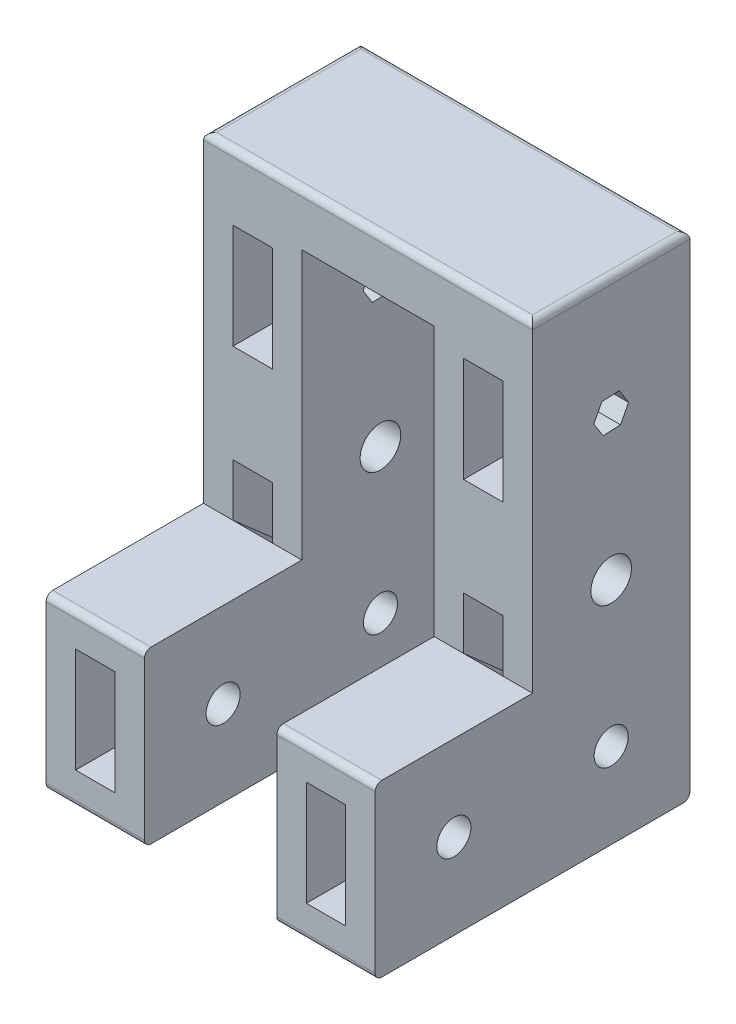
ISO-10303-21;
HEADER;
FILE_DESCRIPTION(('STEP AP214'),'2;1');
FILE_NAME('part.step','',(''),(''),'','','');
FILE_SCHEMA(('AUTOMOTIVE_DESIGN { 1 0 10303 214 1 1 1 1 }'));
ENDSEC;
DATA;
#1=APPLICATION_CONTEXT('core data for automotive mechanical design processes');
#2=APPLICATION_PROTOCOL_DEFINITION('international standard','automotive_design',2000,#1);
#3=PRODUCT_CONTEXT('',#1,'mechanical');
#4=PRODUCT('Part','Part','',(#3));
#5=PRODUCT_RELATED_PRODUCT_CATEGORY('part','',(#4));
#6=PRODUCT_DEFINITION_FORMATION('','',#4);
#7=PRODUCT_DEFINITION_CONTEXT('part definition',#1,'design');
#8=PRODUCT_DEFINITION('design','',#6,#7);
#9=PRODUCT_DEFINITION_SHAPE('','',#8);
#10=(LENGTH_UNIT() NAMED_UNIT(*) SI_UNIT(.MILLI.,.METRE.));
#11=(NAMED_UNIT(*) PLANE_ANGLE_UNIT() SI_UNIT($,.RADIAN.));
#12=(NAMED_UNIT(*) SI_UNIT($,.STERADIAN.) SOLID_ANGLE_UNIT());
#13=UNCERTAINTY_MEASURE_WITH_UNIT(LENGTH_MEASURE(1.E-05),#10,'distance_accuracy_value','');
#14=(GEOMETRIC_REPRESENTATION_CONTEXT(3) GLOBAL_UNCERTAINTY_ASSIGNED_CONTEXT((#13)) GLOBAL_UNIT_ASSIGNED_CONTEXT((#10,
#11,#12)) REPRESENTATION_CONTEXT('',''));
#15=CARTESIAN_POINT('',(0.,0.,0.));
#16=DIRECTION('',(0.,0.,1.));
#17=DIRECTION('',(1.,0.,0.));
#18=AXIS2_PLACEMENT_3D('',#15,#16,#17);
#19=CARTESIAN_POINT('',(-25.1,-18.7957746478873,-14.6514084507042));
#20=DIRECTION('',(1.,0.,0.));
#21=DIRECTION('',(0.,0.,-1.));
#22=AXIS2_PLACEMENT_3D('',#19,#20,#21);
#23=CYLINDRICAL_SURFACE('',#22,2.6);
#24=CARTESIAN_POINT('',(25.1,-18.7957746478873,-14.6514084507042));
#25=DIRECTION('',(1.,0.,0.));
#26=DIRECTION('',(0.,0.,-1.));
#27=AXIS2_PLACEMENT_3D('',#24,#25,#26);
#28=CIRCLE('',#27,2.6);
#29=CARTESIAN_POINT('',(25.1,-18.7957746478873,-17.2514084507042));
#30=VERTEX_POINT('',#29);
#31=EDGE_CURVE('E1021',#30,#30,#28,.T.);
#32=ORIENTED_EDGE('',*,*,#31,.T.);
#33=EDGE_LOOP('',(#32));
#34=FACE_BOUND('',#33,.T.);
#35=CARTESIAN_POINT('',(20.6,-18.7957746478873,-14.6514084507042));
#36=DIRECTION('',(-1.,0.,0.));
#37=DIRECTION('',(0.,0.,1.));
#38=AXIS2_PLACEMENT_3D('',#35,#36,#37);
#39=CIRCLE('',#38,2.6);
#40=CARTESIAN_POINT('',(20.6,-18.7957746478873,-12.0514084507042));
#41=VERTEX_POINT('',#40);
#42=EDGE_CURVE('E1022',#41,#41,#39,.F.);
#43=ORIENTED_EDGE('',*,*,#42,.F.);
#44=EDGE_LOOP('',(#43));
#45=FACE_BOUND('',#44,.T.);
#46=ADVANCED_FACE('F62',(#34,#45),#23,.F.);
#47=CARTESIAN_POINT('',(-10.1,-18.7957746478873,-14.6514084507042));
#48=DIRECTION('',(-1.,0.,0.));
#49=DIRECTION('',(0.,0.,1.));
#50=AXIS2_PLACEMENT_3D('',#47,#48,#49);
#51=CIRCLE('',#50,2.6);
#52=CARTESIAN_POINT('',(-10.1,-18.7957746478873,-12.0514084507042));
#53=VERTEX_POINT('',#52);
#54=EDGE_CURVE('E1316',#53,#53,#51,.F.);
#55=ORIENTED_EDGE('',*,*,#54,.T.);
#56=EDGE_LOOP('',(#55));
#57=FACE_BOUND('',#56,.T.);
#58=CARTESIAN_POINT('',(-14.6,-18.7957746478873,-14.6514084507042));
#59=DIRECTION('',(-1.,0.,0.));
#60=DIRECTION('',(0.,0.,1.));
#61=AXIS2_PLACEMENT_3D('',#58,#59,#60);
#62=CIRCLE('',#61,2.6);
#63=CARTESIAN_POINT('',(-14.6,-18.7957746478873,-12.0514084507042));
#64=VERTEX_POINT('',#63);
#65=EDGE_CURVE('E612',#64,#64,#62,.F.);
#66=ORIENTED_EDGE('',*,*,#65,.F.);
#67=EDGE_LOOP('',(#66));
#68=FACE_BOUND('',#67,.T.);
#69=ADVANCED_FACE('F1013',(#57,#68),#23,.F.);
#70=CARTESIAN_POINT('',(-25.1,-18.7957746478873,9.34859154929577));
#71=DIRECTION('',(1.,0.,0.));
#72=DIRECTION('',(0.,0.,-1.));
#73=AXIS2_PLACEMENT_3D('',#70,#71,#72);
#74=CYLINDRICAL_SURFACE('',#73,2.6);
#75=CARTESIAN_POINT('',(-14.6,-18.7957746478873,9.34859154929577));
#76=DIRECTION('',(1.,0.,0.));
#77=DIRECTION('',(0.,0.,-1.));
#78=AXIS2_PLACEMENT_3D('',#75,#76,#77);
#79=CIRCLE('',#78,2.6);
#80=CARTESIAN_POINT('',(-14.6,-18.7957746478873,6.74859154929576));
#81=VERTEX_POINT('',#80);
#82=EDGE_CURVE('E563',#81,#81,#79,.F.);
#83=ORIENTED_EDGE('',*,*,#82,.T.);
#84=EDGE_LOOP('',(#83));
#85=FACE_BOUND('',#84,.T.);
#86=CARTESIAN_POINT('',(-10.1,-18.7957746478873,9.34859154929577));
#87=DIRECTION('',(-1.,0.,0.));
#88=DIRECTION('',(0.,0.,1.));
#89=AXIS2_PLACEMENT_3D('',#86,#87,#88);
#90=CIRCLE('',#89,2.6);
#91=CARTESIAN_POINT('',(-10.1,-18.7957746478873,11.9485915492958));
#92=VERTEX_POINT('',#91);
#93=EDGE_CURVE('E1306',#92,#92,#90,.F.);
#94=ORIENTED_EDGE('',*,*,#93,.T.);
#95=EDGE_LOOP('',(#94));
#96=FACE_BOUND('',#95,.T.);
#97=ADVANCED_FACE('F962',(#85,#96),#74,.F.);
#98=CARTESIAN_POINT('',(20.6,-18.7957746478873,9.34859154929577));
#99=DIRECTION('',(1.,0.,0.));
#100=DIRECTION('',(0.,1.,0.));
#101=AXIS2_PLACEMENT_3D('',#98,#99,#100);
#102=CIRCLE('',#101,2.6);
#103=CARTESIAN_POINT('',(20.6,-16.1957746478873,9.34859154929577));
#104=VERTEX_POINT('',#103);
#105=EDGE_CURVE('E552',#104,#104,#102,.F.);
#106=ORIENTED_EDGE('',*,*,#105,.T.);
#107=EDGE_LOOP('',(#106));
#108=FACE_BOUND('',#107,.T.);
#109=CARTESIAN_POINT('',(25.1,-18.7957746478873,9.34859154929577));
#110=DIRECTION('',(1.,0.,0.));
#111=DIRECTION('',(0.,0.,-1.));
#112=AXIS2_PLACEMENT_3D('',#109,#110,#111);
#113=CIRCLE('',#112,2.6);
#114=CARTESIAN_POINT('',(25.1,-18.7957746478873,6.74859154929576));
#115=VERTEX_POINT('',#114);
#116=EDGE_CURVE('E1337',#115,#115,#113,.T.);
#117=ORIENTED_EDGE('',*,*,#116,.T.);
#118=EDGE_LOOP('',(#117));
#119=FACE_BOUND('',#118,.T.);
#120=ADVANCED_FACE('F845',(#108,#119),#74,.F.);
#121=CARTESIAN_POINT('',(25.1,-31.7957746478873,-26.6514084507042));
#122=DIRECTION('',(0.,0.,1.));
#123=DIRECTION('',(0.,-1.,0.));
#124=AXIS2_PLACEMENT_3D('',#121,#122,#123);
#125=PLANE('',#124);
#126=DIRECTION('',(1.,0.,0.));
#127=VECTOR('',#126,1.);
#128=CARTESIAN_POINT('',(-20.6,-10.7957746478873,-26.6514084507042));
#129=LINE('',#128,#127);
#130=CARTESIAN_POINT('',(-20.6,-10.7957746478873,-26.6514084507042));
#131=VERTEX_POINT('',#130);
#132=CARTESIAN_POINT('',(-14.6,-10.7957746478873,-26.6514084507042));
#133=VERTEX_POINT('',#132);
#134=EDGE_CURVE('E827',#131,#133,#129,.T.);
#135=ORIENTED_EDGE('',*,*,#134,.F.);
#136=DIRECTION('',(0.,1.,0.));
#137=VECTOR('',#136,1.);
#138=CARTESIAN_POINT('',(-20.6,-26.7957746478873,-26.6514084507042));
#139=LINE('',#138,#137);
#140=CARTESIAN_POINT('',(-20.6,-26.7957746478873,-26.6514084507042));
#141=VERTEX_POINT('',#140);
#142=EDGE_CURVE('E615',#141,#131,#139,.T.);
#143=ORIENTED_EDGE('',*,*,#142,.F.);
#144=DIRECTION('',(-1.,0.,0.));
#145=VECTOR('',#144,1.);
#146=CARTESIAN_POINT('',(-20.6,-26.7957746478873,-26.6514084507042));
#147=LINE('',#146,#145);
#148=CARTESIAN_POINT('',(-14.6,-26.7957746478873,-26.6514084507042));
#149=VERTEX_POINT('',#148);
#150=EDGE_CURVE('E606',#149,#141,#147,.T.);
#151=ORIENTED_EDGE('',*,*,#150,.F.);
#152=DIRECTION('',(0.,-1.,0.));
#153=VECTOR('',#152,1.);
#154=CARTESIAN_POINT('',(-14.6,-26.7957746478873,-26.6514084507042));
#155=LINE('',#154,#153);
#156=EDGE_CURVE('E486',#133,#149,#155,.T.);
#157=ORIENTED_EDGE('',*,*,#156,.F.);
#158=EDGE_LOOP('',(#135,#143,#151,#157));
#159=FACE_BOUND('',#158,.T.);
#160=DIRECTION('',(0.,-1.,0.));
#161=VECTOR('',#160,1.);
#162=CARTESIAN_POINT('',(-20.6,33.2042253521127,-26.6514084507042));
#163=LINE('',#162,#161);
#164=CARTESIAN_POINT('',(-20.6,33.2042253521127,-26.6514084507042));
#165=VERTEX_POINT('',#164);
#166=CARTESIAN_POINT('',(-20.6,17.2042253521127,-26.6514084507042));
#167=VERTEX_POINT('',#166);
#168=EDGE_CURVE('E1061',#165,#167,#163,.T.);
#169=ORIENTED_EDGE('',*,*,#168,.T.);
#170=DIRECTION('',(1.,0.,0.));
#171=VECTOR('',#170,1.);
#172=CARTESIAN_POINT('',(-20.6,17.2042253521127,-26.6514084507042));
#173=LINE('',#172,#171);
#174=CARTESIAN_POINT('',(-14.6,17.2042253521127,-26.6514084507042));
#175=VERTEX_POINT('',#174);
#176=EDGE_CURVE('E1055',#167,#175,#173,.T.);
#177=ORIENTED_EDGE('',*,*,#176,.T.);
#178=DIRECTION('',(0.,-1.,0.));
#179=VECTOR('',#178,1.);
#180=CARTESIAN_POINT('',(-14.6,33.2042253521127,-26.6514084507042));
#181=LINE('',#180,#179);
#182=CARTESIAN_POINT('',(-14.6,33.2042253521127,-26.6514084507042));
#183=VERTEX_POINT('',#182);
#184=EDGE_CURVE('E1057',#183,#175,#181,.T.);
#185=ORIENTED_EDGE('',*,*,#184,.F.);
#186=DIRECTION('',(1.,0.,0.));
#187=VECTOR('',#186,1.);
#188=CARTESIAN_POINT('',(-20.6,33.2042253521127,-26.6514084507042));
#189=LINE('',#188,#187);
#190=EDGE_CURVE('E1058',#165,#183,#189,.T.);
#191=ORIENTED_EDGE('',*,*,#190,.F.);
#192=EDGE_LOOP('',(#169,#177,#185,#191));
#193=FACE_BOUND('',#192,.T.);
#194=DIRECTION('',(0.,-1.,0.));
#195=VECTOR('',#194,1.);
#196=CARTESIAN_POINT('',(14.6,33.2042253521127,-26.6514084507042));
#197=LINE('',#196,#195);
#198=CARTESIAN_POINT('',(14.6,33.2042253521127,-26.6514084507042));
#199=VERTEX_POINT('',#198);
#200=CARTESIAN_POINT('',(14.6,17.2042253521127,-26.6514084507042));
#201=VERTEX_POINT('',#200);
#202=EDGE_CURVE('E1101',#199,#201,#197,.T.);
#203=ORIENTED_EDGE('',*,*,#202,.T.);
#204=DIRECTION('',(1.,0.,0.));
#205=VECTOR('',#204,1.);
#206=CARTESIAN_POINT('',(14.6,17.2042253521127,-26.6514084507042));
#207=LINE('',#206,#205);
#208=CARTESIAN_POINT('',(20.6,17.2042253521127,-26.6514084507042));
#209=VERTEX_POINT('',#208);
#210=EDGE_CURVE('E1113',#201,#209,#207,.T.);
#211=ORIENTED_EDGE('',*,*,#210,.T.);
#212=DIRECTION('',(0.,-1.,0.));
#213=VECTOR('',#212,1.);
#214=CARTESIAN_POINT('',(20.6,33.2042253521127,-26.6514084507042));
#215=LINE('',#214,#213);
#216=CARTESIAN_POINT('',(20.6,33.2042253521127,-26.6514084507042));
#217=VERTEX_POINT('',#216);
#218=EDGE_CURVE('E1135',#217,#209,#215,.T.);
#219=ORIENTED_EDGE('',*,*,#218,.F.);
#220=DIRECTION('',(1.,0.,0.));
#221=VECTOR('',#220,1.);
#222=CARTESIAN_POINT('',(14.6,33.2042253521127,-26.6514084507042));
#223=LINE('',#222,#221);
#224=EDGE_CURVE('E1127',#199,#217,#223,.T.);
#225=ORIENTED_EDGE('',*,*,#224,.F.);
#226=EDGE_LOOP('',(#203,#211,#219,#225));
#227=FACE_BOUND('',#226,.T.);
#228=DIRECTION('',(0.,1.,0.));
#229=VECTOR('',#228,1.);
#230=CARTESIAN_POINT('',(-25.1,-31.7957746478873,-26.6514084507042));
#231=LINE('',#230,#229);
#232=CARTESIAN_POINT('',(-25.1,-30.7957746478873,-26.6514084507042));
#233=VERTEX_POINT('',#232);
#234=CARTESIAN_POINT('',(-25.1,42.2042253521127,-26.6514084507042));
#235=VERTEX_POINT('',#234);
#236=EDGE_CURVE('E755',#233,#235,#231,.T.);
#237=ORIENTED_EDGE('',*,*,#236,.T.);
#238=DIRECTION('',(-1.,0.,0.));
#239=VECTOR('',#238,1.);
#240=CARTESIAN_POINT('',(25.1,42.2042253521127,-26.6514084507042));
#241=LINE('',#240,#239);
#242=CARTESIAN_POINT('',(25.1,42.2042253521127,-26.6514084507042));
#243=VERTEX_POINT('',#242);
#244=EDGE_CURVE('E634',#235,#243,#241,.F.);
#245=ORIENTED_EDGE('',*,*,#244,.T.);
#246=DIRECTION('',(0.,1.,0.));
#247=VECTOR('',#246,1.);
#248=CARTESIAN_POINT('',(25.1,-31.7957746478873,-26.6514084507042));
#249=LINE('',#248,#247);
#250=CARTESIAN_POINT('',(25.1,-30.7957746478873,-26.6514084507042));
#251=VERTEX_POINT('',#250);
#252=EDGE_CURVE('E1446',#251,#243,#249,.T.);
#253=ORIENTED_EDGE('',*,*,#252,.F.);
#254=DIRECTION('',(-1.,0.,0.));
#255=VECTOR('',#254,1.);
#256=CARTESIAN_POINT('',(25.1,-30.7957746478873,-26.6514084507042));
#257=LINE('',#256,#255);
#258=CARTESIAN_POINT('',(10.1,-30.7957746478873,-26.6514084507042));
#259=VERTEX_POINT('',#258);
#260=EDGE_CURVE('E630',#251,#259,#257,.T.);
#261=ORIENTED_EDGE('',*,*,#260,.T.);
#262=DIRECTION('',(0.,-1.,0.));
#263=VECTOR('',#262,1.);
#264=CARTESIAN_POINT('',(10.1,35.2042253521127,-26.6514084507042));
#265=LINE('',#264,#263);
#266=CARTESIAN_POINT('',(10.1,35.2042253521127,-26.6514084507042));
#267=VERTEX_POINT('',#266);
#268=EDGE_CURVE('E1243',#267,#259,#265,.T.);
#269=ORIENTED_EDGE('',*,*,#268,.F.);
#270=DIRECTION('',(1.,0.,0.));
#271=VECTOR('',#270,1.);
#272=CARTESIAN_POINT('',(-10.1,35.2042253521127,-26.6514084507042));
#273=LINE('',#272,#271);
#274=CARTESIAN_POINT('',(-10.1,35.2042253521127,-26.6514084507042));
#275=VERTEX_POINT('',#274);
#276=EDGE_CURVE('E1217',#275,#267,#273,.T.);
#277=ORIENTED_EDGE('',*,*,#276,.F.);
#278=DIRECTION('',(0.,-1.,0.));
#279=VECTOR('',#278,1.);
#280=CARTESIAN_POINT('',(-10.1,35.2042253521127,-26.6514084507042));
#281=LINE('',#280,#279);
#282=CARTESIAN_POINT('',(-10.1,-30.7957746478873,-26.6514084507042));
#283=VERTEX_POINT('',#282);
#284=EDGE_CURVE('E1230',#275,#283,#281,.T.);
#285=ORIENTED_EDGE('',*,*,#284,.T.);
#286=DIRECTION('',(-1.,0.,0.));
#287=VECTOR('',#286,1.);
#288=CARTESIAN_POINT('',(25.1,-30.7957746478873,-26.6514084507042));
#289=LINE('',#288,#287);
#290=EDGE_CURVE('E633',#283,#233,#289,.T.);
#291=ORIENTED_EDGE('',*,*,#290,.T.);
#292=EDGE_LOOP('',(#237,#245,#253,#261,#269,#277,#285,#291));
#293=FACE_BOUND('',#292,.T.);
#294=DIRECTION('',(-1.,0.,0.));
#295=VECTOR('',#294,1.);
#296=CARTESIAN_POINT('',(14.6,-26.7957746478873,-26.6514084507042));
#297=LINE('',#296,#295);
#298=CARTESIAN_POINT('',(20.6,-26.7957746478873,-26.6514084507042));
#299=VERTEX_POINT('',#298);
#300=CARTESIAN_POINT('',(14.6,-26.7957746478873,-26.6514084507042));
#301=VERTEX_POINT('',#300);
#302=EDGE_CURVE('E576',#299,#301,#297,.T.);
#303=ORIENTED_EDGE('',*,*,#302,.F.);
#304=DIRECTION('',(0.,-1.,0.));
#305=VECTOR('',#304,1.);
#306=CARTESIAN_POINT('',(20.6,-26.7957746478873,-26.6514084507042));
#307=LINE('',#306,#305);
#308=CARTESIAN_POINT('',(20.6,-10.7957746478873,-26.6514084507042));
#309=VERTEX_POINT('',#308);
#310=EDGE_CURVE('E562',#309,#299,#307,.T.);
#311=ORIENTED_EDGE('',*,*,#310,.F.);
#312=DIRECTION('',(1.,0.,0.));
#313=VECTOR('',#312,1.);
#314=CARTESIAN_POINT('',(14.6,-10.7957746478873,-26.6514084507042));
#315=LINE('',#314,#313);
#316=CARTESIAN_POINT('',(14.6,-10.7957746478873,-26.6514084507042));
#317=VERTEX_POINT('',#316);
#318=EDGE_CURVE('E580',#317,#309,#315,.T.);
#319=ORIENTED_EDGE('',*,*,#318,.F.);
#320=DIRECTION('',(0.,1.,0.));
#321=VECTOR('',#320,1.);
#322=CARTESIAN_POINT('',(14.6,-26.7957746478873,-26.6514084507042));
#323=LINE('',#322,#321);
#324=EDGE_CURVE('E604',#301,#317,#323,.T.);
#325=ORIENTED_EDGE('',*,*,#324,.F.);
#326=EDGE_LOOP('',(#303,#311,#319,#325));
#327=FACE_BOUND('',#326,.T.);
#328=ADVANCED_FACE('F807',(#159,#193,#227,#293,#327),#125,.F.);
#329=CARTESIAN_POINT('',(25.1,43.2042253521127,-2.65140845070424));
#330=DIRECTION('',(0.,0.,-1.));
#331=DIRECTION('',(0.,1.,0.));
#332=AXIS2_PLACEMENT_3D('',#329,#330,#331);
#333=PLANE('',#332);
#334=DIRECTION('',(0.,-1.,0.));
#335=VECTOR('',#334,1.);
#336=CARTESIAN_POINT('',(-14.6,33.2042253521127,-2.65140845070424));
#337=LINE('',#336,#335);
#338=CARTESIAN_POINT('',(-14.6,33.2042253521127,-2.65140845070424));
#339=VERTEX_POINT('',#338);
#340=CARTESIAN_POINT('',(-14.6,17.2042253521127,-2.65140845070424));
#341=VERTEX_POINT('',#340);
#342=EDGE_CURVE('E1075',#339,#341,#337,.T.);
#343=ORIENTED_EDGE('',*,*,#342,.T.);
#344=DIRECTION('',(1.,0.,0.));
#345=VECTOR('',#344,1.);
#346=CARTESIAN_POINT('',(-20.6,17.2042253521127,-2.65140845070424));
#347=LINE('',#346,#345);
#348=CARTESIAN_POINT('',(-20.6,17.2042253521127,-2.65140845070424));
#349=VERTEX_POINT('',#348);
#350=EDGE_CURVE('E1068',#349,#341,#347,.T.);
#351=ORIENTED_EDGE('',*,*,#350,.F.);
#352=DIRECTION('',(0.,-1.,0.));
#353=VECTOR('',#352,1.);
#354=CARTESIAN_POINT('',(-20.6,33.2042253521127,-2.65140845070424));
#355=LINE('',#354,#353);
#356=CARTESIAN_POINT('',(-20.6,33.2042253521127,-2.65140845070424));
#357=VERTEX_POINT('',#356);
#358=EDGE_CURVE('E1060',#357,#349,#355,.T.);
#359=ORIENTED_EDGE('',*,*,#358,.F.);
#360=DIRECTION('',(1.,0.,0.));
#361=VECTOR('',#360,1.);
#362=CARTESIAN_POINT('',(-20.6,33.2042253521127,-2.65140845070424));
#363=LINE('',#362,#361);
#364=EDGE_CURVE('E1080',#357,#339,#363,.T.);
#365=ORIENTED_EDGE('',*,*,#364,.T.);
#366=EDGE_LOOP('',(#343,#351,#359,#365));
#367=FACE_BOUND('',#366,.T.);
#368=DIRECTION('',(0.,-1.,0.));
#369=VECTOR('',#368,1.);
#370=CARTESIAN_POINT('',(20.6,33.2042253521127,-2.65140845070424));
#371=LINE('',#370,#369);
#372=CARTESIAN_POINT('',(20.6,33.2042253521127,-2.65140845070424));
#373=VERTEX_POINT('',#372);
#374=CARTESIAN_POINT('',(20.6,17.2042253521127,-2.65140845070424));
#375=VERTEX_POINT('',#374);
#376=EDGE_CURVE('E1118',#373,#375,#371,.T.);
#377=ORIENTED_EDGE('',*,*,#376,.T.);
#378=DIRECTION('',(1.,0.,0.));
#379=VECTOR('',#378,1.);
#380=CARTESIAN_POINT('',(14.6,17.2042253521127,-2.65140845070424));
#381=LINE('',#380,#379);
#382=CARTESIAN_POINT('',(14.6,17.2042253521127,-2.65140845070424));
#383=VERTEX_POINT('',#382);
#384=EDGE_CURVE('E1072',#383,#375,#381,.T.);
#385=ORIENTED_EDGE('',*,*,#384,.F.);
#386=DIRECTION('',(0.,-1.,0.));
#387=VECTOR('',#386,1.);
#388=CARTESIAN_POINT('',(14.6,33.2042253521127,-2.65140845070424));
#389=LINE('',#388,#387);
#390=CARTESIAN_POINT('',(14.6,33.2042253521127,-2.65140845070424));
#391=VERTEX_POINT('',#390);
#392=EDGE_CURVE('E1108',#391,#383,#389,.T.);
#393=ORIENTED_EDGE('',*,*,#392,.F.);
#394=DIRECTION('',(1.,0.,0.));
#395=VECTOR('',#394,1.);
#396=CARTESIAN_POINT('',(14.6,33.2042253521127,-2.65140845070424));
#397=LINE('',#396,#395);
#398=EDGE_CURVE('E1111',#391,#373,#397,.T.);
#399=ORIENTED_EDGE('',*,*,#398,.T.);
#400=EDGE_LOOP('',(#377,#385,#393,#399));
#401=FACE_BOUND('',#400,.T.);
#402=DIRECTION('',(0.,-1.,0.));
#403=VECTOR('',#402,1.);
#404=CARTESIAN_POINT('',(25.1,43.2042253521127,-2.65140845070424));
#405=LINE('',#404,#403);
#406=CARTESIAN_POINT('',(25.1,42.2042253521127,-2.65140845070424));
#407=VERTEX_POINT('',#406);
#408=CARTESIAN_POINT('',(25.1,-5.79577464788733,-2.65140845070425));
#409=VERTEX_POINT('',#408);
#410=EDGE_CURVE('E742',#407,#409,#405,.T.);
#411=ORIENTED_EDGE('',*,*,#410,.F.);
#412=DIRECTION('',(-1.,0.,0.));
#413=VECTOR('',#412,1.);
#414=CARTESIAN_POINT('',(25.1,42.2042253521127,-2.65140845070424));
#415=LINE('',#414,#413);
#416=CARTESIAN_POINT('',(-25.1,42.2042253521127,-2.65140845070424));
#417=VERTEX_POINT('',#416);
#418=EDGE_CURVE('E651',#407,#417,#415,.T.);
#419=ORIENTED_EDGE('',*,*,#418,.T.);
#420=DIRECTION('',(0.,-1.,0.));
#421=VECTOR('',#420,1.);
#422=CARTESIAN_POINT('',(-25.1,43.2042253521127,-2.65140845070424));
#423=LINE('',#422,#421);
#424=CARTESIAN_POINT('',(-25.1,-5.79577464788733,-2.65140845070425));
#425=VERTEX_POINT('',#424);
#426=EDGE_CURVE('E738',#417,#425,#423,.T.);
#427=ORIENTED_EDGE('',*,*,#426,.T.);
#428=DIRECTION('',(-1.,0.,0.));
#429=VECTOR('',#428,1.);
#430=CARTESIAN_POINT('',(25.1,-5.79577464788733,-2.65140845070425));
#431=LINE('',#430,#429);
#432=CARTESIAN_POINT('',(-20.6,-5.79577464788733,-2.65140845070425));
#433=VERTEX_POINT('',#432);
#434=EDGE_CURVE('E768',#433,#425,#431,.T.);
#435=ORIENTED_EDGE('',*,*,#434,.F.);
#436=DIRECTION('',(0.,-1.,0.));
#437=VECTOR('',#436,1.);
#438=CARTESIAN_POINT('',(-20.6,-5.79577464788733,-2.65140845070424));
#439=LINE('',#438,#437);
#440=CARTESIAN_POINT('',(-20.6,2.20422535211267,-2.65140845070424));
#441=VERTEX_POINT('',#440);
#442=EDGE_CURVE('E1488',#441,#433,#439,.T.);
#443=ORIENTED_EDGE('',*,*,#442,.F.);
#444=DIRECTION('',(-1.,0.,0.));
#445=VECTOR('',#444,1.);
#446=CARTESIAN_POINT('',(-20.6,2.20422535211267,-2.65140845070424));
#447=LINE('',#446,#445);
#448=CARTESIAN_POINT('',(-14.6,2.20422535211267,-2.65140845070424));
#449=VERTEX_POINT('',#448);
#450=EDGE_CURVE('E1491',#449,#441,#447,.T.);
#451=ORIENTED_EDGE('',*,*,#450,.F.);
#452=DIRECTION('',(0.,1.,0.));
#453=VECTOR('',#452,1.);
#454=CARTESIAN_POINT('',(-14.6,-5.79577464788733,-2.65140845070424));
#455=LINE('',#454,#453);
#456=CARTESIAN_POINT('',(-14.6,-5.79577464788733,-2.65140845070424));
#457=VERTEX_POINT('',#456);
#458=EDGE_CURVE('E1484',#457,#449,#455,.T.);
#459=ORIENTED_EDGE('',*,*,#458,.F.);
#460=CARTESIAN_POINT('',(-10.1,-5.79577464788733,-2.65140845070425));
#461=VERTEX_POINT('',#460);
#462=EDGE_CURVE('E773',#461,#457,#431,.T.);
#463=ORIENTED_EDGE('',*,*,#462,.F.);
#464=DIRECTION('',(0.,1.,0.));
#465=VECTOR('',#464,1.);
#466=CARTESIAN_POINT('',(-10.1,43.2042253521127,-2.65140845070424));
#467=LINE('',#466,#465);
#468=CARTESIAN_POINT('',(-10.1,35.2042253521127,-2.65140845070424));
#469=VERTEX_POINT('',#468);
#470=EDGE_CURVE('E1323',#461,#469,#467,.T.);
#471=ORIENTED_EDGE('',*,*,#470,.T.);
#472=DIRECTION('',(-1.,0.,0.));
#473=VECTOR('',#472,1.);
#474=CARTESIAN_POINT('',(25.1,35.2042253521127,-2.65140845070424));
#475=LINE('',#474,#473);
#476=CARTESIAN_POINT('',(10.1,35.2042253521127,-2.65140845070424));
#477=VERTEX_POINT('',#476);
#478=EDGE_CURVE('E1480',#477,#469,#475,.T.);
#479=ORIENTED_EDGE('',*,*,#478,.F.);
#480=DIRECTION('',(0.,-1.,0.));
#481=VECTOR('',#480,1.);
#482=CARTESIAN_POINT('',(10.1,43.2042253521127,-2.65140845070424));
#483=LINE('',#482,#481);
#484=CARTESIAN_POINT('',(10.1,-5.79577464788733,-2.65140845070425));
#485=VERTEX_POINT('',#484);
#486=EDGE_CURVE('E1284',#477,#485,#483,.T.);
#487=ORIENTED_EDGE('',*,*,#486,.T.);
#488=CARTESIAN_POINT('',(14.6,-5.79577464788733,-2.65140845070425));
#489=VERTEX_POINT('',#488);
#490=EDGE_CURVE('E783',#489,#485,#431,.T.);
#491=ORIENTED_EDGE('',*,*,#490,.F.);
#492=DIRECTION('',(0.,-1.,0.));
#493=VECTOR('',#492,1.);
#494=CARTESIAN_POINT('',(14.6,-5.79577464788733,-2.65140845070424));
#495=LINE('',#494,#493);
#496=CARTESIAN_POINT('',(14.6,2.20422535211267,-2.65140845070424));
#497=VERTEX_POINT('',#496);
#498=EDGE_CURVE('E874',#497,#489,#495,.T.);
#499=ORIENTED_EDGE('',*,*,#498,.F.);
#500=DIRECTION('',(-1.,0.,0.));
#501=VECTOR('',#500,1.);
#502=CARTESIAN_POINT('',(14.6,2.20422535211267,-2.65140845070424));
#503=LINE('',#502,#501);
#504=CARTESIAN_POINT('',(20.6,2.20422535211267,-2.65140845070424));
#505=VERTEX_POINT('',#504);
#506=EDGE_CURVE('E789',#505,#497,#503,.T.);
#507=ORIENTED_EDGE('',*,*,#506,.F.);
#508=DIRECTION('',(0.,1.,0.));
#509=VECTOR('',#508,1.);
#510=CARTESIAN_POINT('',(20.6,-5.79577464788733,-2.65140845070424));
#511=LINE('',#510,#509);
#512=CARTESIAN_POINT('',(20.6,-5.79577464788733,-2.65140845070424));
#513=VERTEX_POINT('',#512);
#514=EDGE_CURVE('E865',#513,#505,#511,.T.);
#515=ORIENTED_EDGE('',*,*,#514,.F.);
#516=EDGE_CURVE('E780',#409,#513,#431,.T.);
#517=ORIENTED_EDGE('',*,*,#516,.F.);
#518=EDGE_LOOP('',(#411,#419,#427,#435,#443,#451,#459,#463,#471,#479,#487,#491,#499,#507,#515,#517));
#519=FACE_BOUND('',#518,.T.);
#520=ADVANCED_FACE('F739',(#367,#401,#519),#333,.F.);
#521=CARTESIAN_POINT('',(10.1,-18.7957746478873,-14.6514084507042));
#522=DIRECTION('',(1.,0.,0.));
#523=DIRECTION('',(0.,0.,-1.));
#524=AXIS2_PLACEMENT_3D('',#521,#522,#523);
#525=CIRCLE('',#524,2.6);
#526=CARTESIAN_POINT('',(10.1,-18.7957746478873,-17.2514084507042));
#527=VERTEX_POINT('',#526);
#528=EDGE_CURVE('E1280',#527,#527,#525,.F.);
#529=ORIENTED_EDGE('',*,*,#528,.T.);
#530=EDGE_LOOP('',(#529));
#531=FACE_BOUND('',#530,.T.);
#532=CARTESIAN_POINT('',(14.6,-18.7957746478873,-14.6514084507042));
#533=DIRECTION('',(1.,0.,0.));
#534=DIRECTION('',(0.,0.,-1.));
#535=AXIS2_PLACEMENT_3D('',#532,#533,#534);
#536=CIRCLE('',#535,2.6);
#537=CARTESIAN_POINT('',(14.6,-18.7957746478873,-17.2514084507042));
#538=VERTEX_POINT('',#537);
#539=EDGE_CURVE('E590',#538,#538,#536,.F.);
#540=ORIENTED_EDGE('',*,*,#539,.F.);
#541=EDGE_LOOP('',(#540));
#542=FACE_BOUND('',#541,.T.);
#543=ADVANCED_FACE('F804',(#531,#542),#23,.F.);
#544=CARTESIAN_POINT('',(-25.1,-18.7957746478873,-14.6514084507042));
#545=DIRECTION('',(1.,0.,0.));
#546=DIRECTION('',(0.,0.,-1.));
#547=AXIS2_PLACEMENT_3D('',#544,#545,#546);
#548=CIRCLE('',#547,2.6);
#549=CARTESIAN_POINT('',(-25.1,-18.7957746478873,-17.2514084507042));
#550=VERTEX_POINT('',#549);
#551=EDGE_CURVE('E1435',#550,#550,#548,.T.);
#552=ORIENTED_EDGE('',*,*,#551,.F.);
#553=EDGE_LOOP('',(#552));
#554=FACE_BOUND('',#553,.T.);
#555=CARTESIAN_POINT('',(-20.6,-18.7957746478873,-14.6514084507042));
#556=DIRECTION('',(1.,0.,0.));
#557=DIRECTION('',(0.,0.,-1.));
#558=AXIS2_PLACEMENT_3D('',#555,#556,#557);
#559=CIRCLE('',#558,2.6);
#560=CARTESIAN_POINT('',(-20.6,-18.7957746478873,-17.2514084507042));
#561=VERTEX_POINT('',#560);
#562=EDGE_CURVE('E1050',#561,#561,#559,.F.);
#563=ORIENTED_EDGE('',*,*,#562,.F.);
#564=EDGE_LOOP('',(#563));
#565=FACE_BOUND('',#564,.T.);
#566=ADVANCED_FACE('F998',(#554,#565),#23,.F.);
#567=CARTESIAN_POINT('',(-25.1,25.3163770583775,-17.3048506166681));
#568=DIRECTION('',(0.,0.536125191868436,-0.844138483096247));
#569=DIRECTION('',(0.,0.844138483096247,0.536125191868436));
#570=AXIS2_PLACEMENT_3D('',#567,#568,#569);
#571=PLANE('',#570);
#572=DIRECTION('',(0.,0.844138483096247,0.536125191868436));
#573=VECTOR('',#572,1.);
#574=CARTESIAN_POINT('',(-14.6,25.3163770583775,-17.3048506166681));
#575=LINE('',#574,#573);
#576=CARTESIAN_POINT('',(-14.6,25.3163770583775,-17.3048506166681));
#577=VERTEX_POINT('',#576);
#578=CARTESIAN_POINT('',(-14.6,27.5582495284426,-15.8810033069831));
#579=VERTEX_POINT('',#578);
#580=EDGE_CURVE('E1190',#577,#579,#575,.T.);
#581=ORIENTED_EDGE('',*,*,#580,.F.);
#582=DIRECTION('',(1.,0.,0.));
#583=VECTOR('',#582,1.);
#584=CARTESIAN_POINT('',(-25.1,25.3163770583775,-17.3048506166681));
#585=LINE('',#584,#583);
#586=CARTESIAN_POINT('',(-10.1,25.3163770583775,-17.3048506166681));
#587=VERTEX_POINT('',#586);
#588=EDGE_CURVE('E1384',#577,#587,#585,.T.);
#589=ORIENTED_EDGE('',*,*,#588,.T.);
#590=DIRECTION('',(0.,0.844138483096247,0.536125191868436));
#591=VECTOR('',#590,1.);
#592=CARTESIAN_POINT('',(-10.1,25.3163770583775,-17.3048506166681));
#593=LINE('',#592,#591);
#594=CARTESIAN_POINT('',(-10.1,27.5582495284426,-15.8810033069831));
#595=VERTEX_POINT('',#594);
#596=EDGE_CURVE('E1303',#587,#595,#593,.T.);
#597=ORIENTED_EDGE('',*,*,#596,.T.);
#598=DIRECTION('',(1.,0.,0.));
#599=VECTOR('',#598,1.);
#600=CARTESIAN_POINT('',(-25.1,27.5582495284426,-15.8810033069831));
#601=LINE('',#600,#599);
#602=EDGE_CURVE('E1349',#579,#595,#601,.T.);
#603=ORIENTED_EDGE('',*,*,#602,.F.);
#604=EDGE_LOOP('',(#581,#589,#597,#603));
#605=FACE_BOUND('',#604,.T.);
#606=ADVANCED_FACE('F970',(#605),#571,.F.);
#607=CARTESIAN_POINT('',(-25.1,22.9623528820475,-16.0752557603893));
#608=DIRECTION('',(0.,-0.462982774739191,-0.886367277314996));
#609=DIRECTION('',(0.,0.886367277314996,-0.462982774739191));
#610=AXIS2_PLACEMENT_3D('',#607,#608,#609);
#611=PLANE('',#610);
#612=DIRECTION('',(0.,0.886367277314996,-0.462982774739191));
#613=VECTOR('',#612,1.);
#614=CARTESIAN_POINT('',(-14.6,22.9623528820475,-16.0752557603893));
#615=LINE('',#614,#613);
#616=CARTESIAN_POINT('',(-14.6,22.9623528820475,-16.0752557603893));
#617=VERTEX_POINT('',#616);
#618=EDGE_CURVE('E1181',#617,#577,#615,.T.);
#619=ORIENTED_EDGE('',*,*,#618,.F.);
#620=DIRECTION('',(1.,0.,0.));
#621=VECTOR('',#620,1.);
#622=CARTESIAN_POINT('',(-25.1,22.9623528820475,-16.0752557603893));
#623=LINE('',#622,#621);
#624=CARTESIAN_POINT('',(-10.1,22.9623528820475,-16.0752557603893));
#625=VERTEX_POINT('',#624);
#626=EDGE_CURVE('E1377',#617,#625,#623,.T.);
#627=ORIENTED_EDGE('',*,*,#626,.T.);
#628=DIRECTION('',(0.,0.886367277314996,-0.462982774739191));
#629=VECTOR('',#628,1.);
#630=CARTESIAN_POINT('',(-10.1,22.9623528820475,-16.0752557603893));
#631=LINE('',#630,#629);
#632=EDGE_CURVE('E1299',#625,#587,#631,.T.);
#633=ORIENTED_EDGE('',*,*,#632,.T.);
#634=ORIENTED_EDGE('',*,*,#588,.F.);
#635=EDGE_LOOP('',(#619,#627,#633,#634));
#636=FACE_BOUND('',#635,.T.);
#637=ADVANCED_FACE('F994',(#636),#611,.F.);
#638=CARTESIAN_POINT('',(-25.1,22.8502011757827,-13.4218135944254));
#639=DIRECTION('',(0.,-0.999107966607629,-0.0422287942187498));
#640=DIRECTION('',(0.,0.0422287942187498,-0.999107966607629));
#641=AXIS2_PLACEMENT_3D('',#638,#639,#640);
#642=PLANE('',#641);
#643=DIRECTION('',(0.,0.0422287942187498,-0.999107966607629));
#644=VECTOR('',#643,1.);
#645=CARTESIAN_POINT('',(-14.6,22.8502011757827,-13.4218135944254));
#646=LINE('',#645,#644);
#647=CARTESIAN_POINT('',(-14.6,22.8502011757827,-13.4218135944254));
#648=VERTEX_POINT('',#647);
#649=EDGE_CURVE('E1182',#648,#617,#646,.T.);
#650=ORIENTED_EDGE('',*,*,#649,.F.);
#651=DIRECTION('',(1.,0.,0.));
#652=VECTOR('',#651,1.);
#653=CARTESIAN_POINT('',(-25.1,22.8502011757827,-13.4218135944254));
#654=LINE('',#653,#652);
#655=CARTESIAN_POINT('',(-10.1,22.8502011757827,-13.4218135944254));
#656=VERTEX_POINT('',#655);
#657=EDGE_CURVE('E1371',#648,#656,#654,.T.);
#658=ORIENTED_EDGE('',*,*,#657,.T.);
#659=DIRECTION('',(0.,0.0422287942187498,-0.999107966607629));
#660=VECTOR('',#659,1.);
#661=CARTESIAN_POINT('',(-10.1,22.8502011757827,-13.4218135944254));
#662=LINE('',#661,#660);
#663=EDGE_CURVE('E1296',#656,#625,#662,.T.);
#664=ORIENTED_EDGE('',*,*,#663,.T.);
#665=ORIENTED_EDGE('',*,*,#626,.F.);
#666=EDGE_LOOP('',(#650,#658,#664,#665));
#667=FACE_BOUND('',#666,.T.);
#668=ADVANCED_FACE('F988',(#667),#642,.F.);
#669=CARTESIAN_POINT('',(-25.1,25.0920736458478,-11.9979662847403));
#670=DIRECTION('',(0.,-0.536125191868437,0.844138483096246));
#671=DIRECTION('',(0.,-0.844138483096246,-0.536125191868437));
#672=AXIS2_PLACEMENT_3D('',#669,#670,#671);
#673=PLANE('',#672);
#674=DIRECTION('',(0.,-0.844138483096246,-0.536125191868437));
#675=VECTOR('',#674,1.);
#676=CARTESIAN_POINT('',(-14.6,25.0920736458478,-11.9979662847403));
#677=LINE('',#676,#675);
#678=CARTESIAN_POINT('',(-14.6,25.0920736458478,-11.9979662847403));
#679=VERTEX_POINT('',#678);
#680=EDGE_CURVE('E1177',#679,#648,#677,.T.);
#681=ORIENTED_EDGE('',*,*,#680,.F.);
#682=DIRECTION('',(1.,0.,0.));
#683=VECTOR('',#682,1.);
#684=CARTESIAN_POINT('',(-25.1,25.0920736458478,-11.9979662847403));
#685=LINE('',#684,#683);
#686=CARTESIAN_POINT('',(-10.1,25.0920736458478,-11.9979662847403));
#687=VERTEX_POINT('',#686);
#688=EDGE_CURVE('E1361',#679,#687,#685,.T.);
#689=ORIENTED_EDGE('',*,*,#688,.T.);
#690=DIRECTION('',(0.,-0.844138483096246,-0.536125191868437));
#691=VECTOR('',#690,1.);
#692=CARTESIAN_POINT('',(-10.1,25.0920736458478,-11.9979662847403));
#693=LINE('',#692,#691);
#694=EDGE_CURVE('E1295',#687,#656,#693,.T.);
#695=ORIENTED_EDGE('',*,*,#694,.T.);
#696=ORIENTED_EDGE('',*,*,#657,.F.);
#697=EDGE_LOOP('',(#681,#689,#695,#696));
#698=FACE_BOUND('',#697,.T.);
#699=ADVANCED_FACE('F983',(#698),#673,.F.);
#700=CARTESIAN_POINT('',(-25.1,27.4460978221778,-13.2275611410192));
#701=DIRECTION('',(0.,0.462982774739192,0.886367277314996));
#702=DIRECTION('',(0.,-0.886367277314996,0.462982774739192));
#703=AXIS2_PLACEMENT_3D('',#700,#701,#702);
#704=PLANE('',#703);
#705=DIRECTION('',(0.,-0.886367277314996,0.462982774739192));
#706=VECTOR('',#705,1.);
#707=CARTESIAN_POINT('',(-14.6,27.4460978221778,-13.2275611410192));
#708=LINE('',#707,#706);
#709=CARTESIAN_POINT('',(-14.6,27.4460978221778,-13.2275611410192));
#710=VERTEX_POINT('',#709);
#711=EDGE_CURVE('E1174',#710,#679,#708,.T.);
#712=ORIENTED_EDGE('',*,*,#711,.F.);
#713=DIRECTION('',(1.,0.,0.));
#714=VECTOR('',#713,1.);
#715=CARTESIAN_POINT('',(-25.1,27.4460978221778,-13.2275611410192));
#716=LINE('',#715,#714);
#717=CARTESIAN_POINT('',(-10.1,27.4460978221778,-13.2275611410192));
#718=VERTEX_POINT('',#717);
#719=EDGE_CURVE('E1360',#710,#718,#716,.T.);
#720=ORIENTED_EDGE('',*,*,#719,.T.);
#721=DIRECTION('',(0.,-0.886367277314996,0.462982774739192));
#722=VECTOR('',#721,1.);
#723=CARTESIAN_POINT('',(-10.1,27.4460978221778,-13.2275611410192));
#724=LINE('',#723,#722);
#725=EDGE_CURVE('E1289',#718,#687,#724,.T.);
#726=ORIENTED_EDGE('',*,*,#725,.T.);
#727=ORIENTED_EDGE('',*,*,#688,.F.);
#728=EDGE_LOOP('',(#712,#720,#726,#727));
#729=FACE_BOUND('',#728,.T.);
#730=ADVANCED_FACE('F978',(#729),#704,.F.);
#731=CARTESIAN_POINT('',(-25.1,27.5582495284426,-15.8810033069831));
#732=DIRECTION('',(0.,0.999107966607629,0.0422287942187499));
#733=DIRECTION('',(0.,-0.0422287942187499,0.999107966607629));
#734=AXIS2_PLACEMENT_3D('',#731,#732,#733);
#735=PLANE('',#734);
#736=DIRECTION('',(0.,-0.0422287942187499,0.999107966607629));
#737=VECTOR('',#736,1.);
#738=CARTESIAN_POINT('',(-14.6,27.5582495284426,-15.8810033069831));
#739=LINE('',#738,#737);
#740=EDGE_CURVE('E1175',#579,#710,#739,.T.);
#741=ORIENTED_EDGE('',*,*,#740,.F.);
#742=ORIENTED_EDGE('',*,*,#602,.T.);
#743=DIRECTION('',(0.,-0.0422287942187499,0.999107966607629));
#744=VECTOR('',#743,1.);
#745=CARTESIAN_POINT('',(-10.1,27.5582495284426,-15.8810033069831));
#746=LINE('',#745,#744);
#747=EDGE_CURVE('E1586',#595,#718,#746,.T.);
#748=ORIENTED_EDGE('',*,*,#747,.T.);
#749=ORIENTED_EDGE('',*,*,#719,.F.);
#750=EDGE_LOOP('',(#741,#742,#748,#749));
#751=FACE_BOUND('',#750,.T.);
#752=ADVANCED_FACE('F972',(#751),#735,.F.);
#753=DIRECTION('',(0.,0.844138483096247,0.536125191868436));
#754=VECTOR('',#753,1.);
#755=CARTESIAN_POINT('',(20.6,25.3163770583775,-17.3048506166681));
#756=LINE('',#755,#754);
#757=CARTESIAN_POINT('',(20.6,25.3163770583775,-17.3048506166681));
#758=VERTEX_POINT('',#757);
#759=CARTESIAN_POINT('',(20.6,27.5582495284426,-15.8810033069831));
#760=VERTEX_POINT('',#759);
#761=EDGE_CURVE('E1148',#758,#760,#756,.T.);
#762=ORIENTED_EDGE('',*,*,#761,.F.);
#763=CARTESIAN_POINT('',(25.1,25.3163770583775,-17.3048506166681));
#764=VERTEX_POINT('',#763);
#765=EDGE_CURVE('E1330',#758,#764,#585,.T.);
#766=ORIENTED_EDGE('',*,*,#765,.T.);
#767=DIRECTION('',(0.,0.844138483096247,0.536125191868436));
#768=VECTOR('',#767,1.);
#769=CARTESIAN_POINT('',(25.1,25.3163770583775,-17.3048506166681));
#770=LINE('',#769,#768);
#771=CARTESIAN_POINT('',(25.1,27.5582495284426,-15.8810033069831));
#772=VERTEX_POINT('',#771);
#773=EDGE_CURVE('E1343',#764,#772,#770,.T.);
#774=ORIENTED_EDGE('',*,*,#773,.T.);
#775=EDGE_CURVE('E1357',#760,#772,#601,.T.);
#776=ORIENTED_EDGE('',*,*,#775,.F.);
#777=EDGE_LOOP('',(#762,#766,#774,#776));
#778=FACE_BOUND('',#777,.T.);
#779=ADVANCED_FACE('F1617',(#778),#571,.F.);
#780=DIRECTION('',(0.,0.886367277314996,-0.462982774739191));
#781=VECTOR('',#780,1.);
#782=CARTESIAN_POINT('',(20.6,22.9623528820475,-16.0752557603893));
#783=LINE('',#782,#781);
#784=CARTESIAN_POINT('',(20.6,22.9623528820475,-16.0752557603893));
#785=VERTEX_POINT('',#784);
#786=EDGE_CURVE('E1146',#785,#758,#783,.T.);
#787=ORIENTED_EDGE('',*,*,#786,.F.);
#788=CARTESIAN_POINT('',(25.1,22.9623528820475,-16.0752557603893));
#789=VERTEX_POINT('',#788);
#790=EDGE_CURVE('E1385',#785,#789,#623,.T.);
#791=ORIENTED_EDGE('',*,*,#790,.T.);
#792=DIRECTION('',(0.,0.886367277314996,-0.462982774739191));
#793=VECTOR('',#792,1.);
#794=CARTESIAN_POINT('',(25.1,22.9623528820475,-16.0752557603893));
#795=LINE('',#794,#793);
#796=EDGE_CURVE('E1390',#789,#764,#795,.T.);
#797=ORIENTED_EDGE('',*,*,#796,.T.);
#798=ORIENTED_EDGE('',*,*,#765,.F.);
#799=EDGE_LOOP('',(#787,#791,#797,#798));
#800=FACE_BOUND('',#799,.T.);
#801=ADVANCED_FACE('F1654',(#800),#611,.F.);
#802=DIRECTION('',(0.,0.0422287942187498,-0.999107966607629));
#803=VECTOR('',#802,1.);
#804=CARTESIAN_POINT('',(20.6,22.8502011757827,-13.4218135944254));
#805=LINE('',#804,#803);
#806=CARTESIAN_POINT('',(20.6,22.8502011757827,-13.4218135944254));
#807=VERTEX_POINT('',#806);
#808=EDGE_CURVE('E1142',#807,#785,#805,.T.);
#809=ORIENTED_EDGE('',*,*,#808,.F.);
#810=CARTESIAN_POINT('',(25.1,22.8502011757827,-13.4218135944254));
#811=VERTEX_POINT('',#810);
#812=EDGE_CURVE('E1380',#807,#811,#654,.T.);
#813=ORIENTED_EDGE('',*,*,#812,.T.);
#814=DIRECTION('',(0.,0.0422287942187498,-0.999107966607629));
#815=VECTOR('',#814,1.);
#816=CARTESIAN_POINT('',(25.1,22.8502011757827,-13.4218135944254));
#817=LINE('',#816,#815);
#818=EDGE_CURVE('E1391',#811,#789,#817,.T.);
#819=ORIENTED_EDGE('',*,*,#818,.T.);
#820=ORIENTED_EDGE('',*,*,#790,.F.);
#821=EDGE_LOOP('',(#809,#813,#819,#820));
#822=FACE_BOUND('',#821,.T.);
#823=ADVANCED_FACE('F1628',(#822),#642,.F.);
#824=DIRECTION('',(0.,-0.844138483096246,-0.536125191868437));
#825=VECTOR('',#824,1.);
#826=CARTESIAN_POINT('',(20.6,25.0920736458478,-11.9979662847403));
#827=LINE('',#826,#825);
#828=CARTESIAN_POINT('',(20.6,25.0920736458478,-11.9979662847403));
#829=VERTEX_POINT('',#828);
#830=EDGE_CURVE('E1138',#829,#807,#827,.T.);
#831=ORIENTED_EDGE('',*,*,#830,.F.);
#832=CARTESIAN_POINT('',(25.1,25.0920736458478,-11.9979662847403));
#833=VERTEX_POINT('',#832);
#834=EDGE_CURVE('E1369',#829,#833,#685,.T.);
#835=ORIENTED_EDGE('',*,*,#834,.T.);
#836=DIRECTION('',(0.,-0.844138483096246,-0.536125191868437));
#837=VECTOR('',#836,1.);
#838=CARTESIAN_POINT('',(25.1,25.0920736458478,-11.9979662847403));
#839=LINE('',#838,#837);
#840=EDGE_CURVE('E1396',#833,#811,#839,.T.);
#841=ORIENTED_EDGE('',*,*,#840,.T.);
#842=ORIENTED_EDGE('',*,*,#812,.F.);
#843=EDGE_LOOP('',(#831,#835,#841,#842));
#844=FACE_BOUND('',#843,.T.);
#845=ADVANCED_FACE('F1621',(#844),#673,.F.);
#846=DIRECTION('',(0.,-0.886367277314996,0.462982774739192));
#847=VECTOR('',#846,1.);
#848=CARTESIAN_POINT('',(20.6,27.4460978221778,-13.2275611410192));
#849=LINE('',#848,#847);
#850=CARTESIAN_POINT('',(20.6,27.4460978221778,-13.2275611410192));
#851=VERTEX_POINT('',#850);
#852=EDGE_CURVE('E1090',#851,#829,#849,.T.);
#853=ORIENTED_EDGE('',*,*,#852,.F.);
#854=CARTESIAN_POINT('',(25.1,27.4460978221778,-13.2275611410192));
#855=VERTEX_POINT('',#854);
#856=EDGE_CURVE('E1364',#851,#855,#716,.T.);
#857=ORIENTED_EDGE('',*,*,#856,.T.);
#858=DIRECTION('',(0.,-0.886367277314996,0.462982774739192));
#859=VECTOR('',#858,1.);
#860=CARTESIAN_POINT('',(25.1,27.4460978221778,-13.2275611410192));
#861=LINE('',#860,#859);
#862=EDGE_CURVE('E1399',#855,#833,#861,.T.);
#863=ORIENTED_EDGE('',*,*,#862,.T.);
#864=ORIENTED_EDGE('',*,*,#834,.F.);
#865=EDGE_LOOP('',(#853,#857,#863,#864));
#866=FACE_BOUND('',#865,.T.);
#867=ADVANCED_FACE('F1614',(#866),#704,.F.);
#868=DIRECTION('',(0.,-0.0422287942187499,0.999107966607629));
#869=VECTOR('',#868,1.);
#870=CARTESIAN_POINT('',(20.6,27.5582495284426,-15.8810033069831));
#871=LINE('',#870,#869);
#872=EDGE_CURVE('E1035',#760,#851,#871,.T.);
#873=ORIENTED_EDGE('',*,*,#872,.F.);
#874=ORIENTED_EDGE('',*,*,#775,.T.);
#875=DIRECTION('',(0.,-0.0422287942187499,0.999107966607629));
#876=VECTOR('',#875,1.);
#877=CARTESIAN_POINT('',(25.1,27.5582495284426,-15.8810033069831));
#878=LINE('',#877,#876);
#879=EDGE_CURVE('E1403',#772,#855,#878,.T.);
#880=ORIENTED_EDGE('',*,*,#879,.T.);
#881=ORIENTED_EDGE('',*,*,#856,.F.);
#882=EDGE_LOOP('',(#873,#874,#880,#881));
#883=FACE_BOUND('',#882,.T.);
#884=ADVANCED_FACE('F1619',(#883),#735,.F.);
#885=CARTESIAN_POINT('',(25.1,-5.79577464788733,21.3485915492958));
#886=DIRECTION('',(0.,0.,-1.));
#887=DIRECTION('',(0.,1.,0.));
#888=AXIS2_PLACEMENT_3D('',#885,#886,#887);
#889=PLANE('',#888);
#890=DIRECTION('',(1.,0.,0.));
#891=VECTOR('',#890,1.);
#892=CARTESIAN_POINT('',(-20.6,-10.7957746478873,21.3485915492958));
#893=LINE('',#892,#891);
#894=CARTESIAN_POINT('',(-20.6,-10.7957746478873,21.3485915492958));
#895=VERTEX_POINT('',#894);
#896=CARTESIAN_POINT('',(-14.6,-10.7957746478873,21.3485915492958));
#897=VERTEX_POINT('',#896);
#898=EDGE_CURVE('E492',#895,#897,#893,.T.);
#899=ORIENTED_EDGE('',*,*,#898,.T.);
#900=DIRECTION('',(0.,-1.,0.));
#901=VECTOR('',#900,1.);
#902=CARTESIAN_POINT('',(-14.6,-26.7957746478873,21.3485915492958));
#903=LINE('',#902,#901);
#904=CARTESIAN_POINT('',(-14.6,-26.7957746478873,21.3485915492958));
#905=VERTEX_POINT('',#904);
#906=EDGE_CURVE('E484',#897,#905,#903,.T.);
#907=ORIENTED_EDGE('',*,*,#906,.T.);
#908=DIRECTION('',(-1.,0.,0.));
#909=VECTOR('',#908,1.);
#910=CARTESIAN_POINT('',(-20.6,-26.7957746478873,21.3485915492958));
#911=LINE('',#910,#909);
#912=CARTESIAN_POINT('',(-20.6,-26.7957746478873,21.3485915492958));
#913=VERTEX_POINT('',#912);
#914=EDGE_CURVE('E498',#905,#913,#911,.T.);
#915=ORIENTED_EDGE('',*,*,#914,.T.);
#916=DIRECTION('',(0.,1.,0.));
#917=VECTOR('',#916,1.);
#918=CARTESIAN_POINT('',(-20.6,-26.7957746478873,21.3485915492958));
#919=LINE('',#918,#917);
#920=EDGE_CURVE('E502',#913,#895,#919,.T.);
#921=ORIENTED_EDGE('',*,*,#920,.T.);
#922=EDGE_LOOP('',(#899,#907,#915,#921));
#923=FACE_BOUND('',#922,.T.);
#924=DIRECTION('',(0.,-1.,0.));
#925=VECTOR('',#924,1.);
#926=CARTESIAN_POINT('',(-25.1,-5.79577464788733,21.3485915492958));
#927=LINE('',#926,#925);
#928=CARTESIAN_POINT('',(-25.1,-6.79577464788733,21.3485915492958));
#929=VERTEX_POINT('',#928);
#930=CARTESIAN_POINT('',(-25.1,-30.7957746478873,21.3485915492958));
#931=VERTEX_POINT('',#930);
#932=EDGE_CURVE('E1437',#929,#931,#927,.T.);
#933=ORIENTED_EDGE('',*,*,#932,.T.);
#934=DIRECTION('',(-1.,0.,0.));
#935=VECTOR('',#934,1.);
#936=CARTESIAN_POINT('',(25.1,-30.7957746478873,21.3485915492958));
#937=LINE('',#936,#935);
#938=CARTESIAN_POINT('',(-10.1,-30.7957746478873,21.3485915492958));
#939=VERTEX_POINT('',#938);
#940=EDGE_CURVE('E687',#931,#939,#937,.F.);
#941=ORIENTED_EDGE('',*,*,#940,.T.);
#942=DIRECTION('',(0.,-1.,0.));
#943=VECTOR('',#942,1.);
#944=CARTESIAN_POINT('',(-10.1,35.2042253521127,21.3485915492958));
#945=LINE('',#944,#943);
#946=CARTESIAN_POINT('',(-10.1,-6.79577464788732,21.3485915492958));
#947=VERTEX_POINT('',#946);
#948=EDGE_CURVE('E1235',#947,#939,#945,.T.);
#949=ORIENTED_EDGE('',*,*,#948,.F.);
#950=DIRECTION('',(-1.,0.,0.));
#951=VECTOR('',#950,1.);
#952=CARTESIAN_POINT('',(25.1,-6.79577464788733,21.3485915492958));
#953=LINE('',#952,#951);
#954=EDGE_CURVE('E685',#947,#929,#953,.T.);
#955=ORIENTED_EDGE('',*,*,#954,.T.);
#956=EDGE_LOOP('',(#933,#941,#949,#955));
#957=FACE_BOUND('',#956,.T.);
#958=ADVANCED_FACE('F504',(#923,#957),#889,.F.);
#959=CARTESIAN_POINT('',(25.1,-31.7957746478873,21.3485915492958));
#960=DIRECTION('',(0.,1.,0.));
#961=DIRECTION('',(0.,0.,1.));
#962=AXIS2_PLACEMENT_3D('',#959,#960,#961);
#963=PLANE('',#962);
#964=DIRECTION('',(0.,0.,-1.));
#965=VECTOR('',#964,1.);
#966=CARTESIAN_POINT('',(-25.1,-31.7957746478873,21.3485915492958));
#967=LINE('',#966,#965);
#968=CARTESIAN_POINT('',(-25.1,-31.7957746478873,20.3485915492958));
#969=VERTEX_POINT('',#968);
#970=CARTESIAN_POINT('',(-25.1,-31.7957746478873,-25.6514084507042));
#971=VERTEX_POINT('',#970);
#972=EDGE_CURVE('E756',#969,#971,#967,.T.);
#973=ORIENTED_EDGE('',*,*,#972,.T.);
#974=DIRECTION('',(-1.,0.,0.));
#975=VECTOR('',#974,1.);
#976=CARTESIAN_POINT('',(25.1,-31.7957746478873,-25.6514084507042));
#977=LINE('',#976,#975);
#978=CARTESIAN_POINT('',(-10.1,-31.7957746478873,-25.6514084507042));
#979=VERTEX_POINT('',#978);
#980=EDGE_CURVE('E669',#971,#979,#977,.F.);
#981=ORIENTED_EDGE('',*,*,#980,.T.);
#982=DIRECTION('',(0.,0.,-1.));
#983=VECTOR('',#982,1.);
#984=CARTESIAN_POINT('',(-10.1,-31.7957746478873,21.3485915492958));
#985=LINE('',#984,#983);
#986=CARTESIAN_POINT('',(-10.1,-31.7957746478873,20.3485915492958));
#987=VERTEX_POINT('',#986);
#988=EDGE_CURVE('E1211',#987,#979,#985,.T.);
#989=ORIENTED_EDGE('',*,*,#988,.F.);
#990=DIRECTION('',(-1.,0.,0.));
#991=VECTOR('',#990,1.);
#992=CARTESIAN_POINT('',(25.1,-31.7957746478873,20.3485915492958));
#993=LINE('',#992,#991);
#994=EDGE_CURVE('E666',#987,#969,#993,.T.);
#995=ORIENTED_EDGE('',*,*,#994,.T.);
#996=EDGE_LOOP('',(#973,#981,#989,#995));
#997=FACE_BOUND('',#996,.T.);
#998=ADVANCED_FACE('F842',(#997),#963,.F.);
#999=DIRECTION('',(0.,0.,-1.));
#1000=VECTOR('',#999,1.);
#1001=CARTESIAN_POINT('',(25.1,-31.7957746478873,21.3485915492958));
#1002=LINE('',#1001,#1000);
#1003=CARTESIAN_POINT('',(25.1,-31.7957746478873,20.3485915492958));
#1004=VERTEX_POINT('',#1003);
#1005=CARTESIAN_POINT('',(25.1,-31.7957746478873,-25.6514084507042));
#1006=VERTEX_POINT('',#1005);
#1007=EDGE_CURVE('E1445',#1004,#1006,#1002,.T.);
#1008=ORIENTED_EDGE('',*,*,#1007,.F.);
#1009=DIRECTION('',(-1.,0.,0.));
#1010=VECTOR('',#1009,1.);
#1011=CARTESIAN_POINT('',(25.1,-31.7957746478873,20.3485915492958));
#1012=LINE('',#1011,#1010);
#1013=CARTESIAN_POINT('',(10.1,-31.7957746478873,20.3485915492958));
#1014=VERTEX_POINT('',#1013);
#1015=EDGE_CURVE('E12',#1004,#1014,#1012,.T.);
#1016=ORIENTED_EDGE('',*,*,#1015,.T.);
#1017=DIRECTION('',(0.,0.,1.));
#1018=VECTOR('',#1017,1.);
#1019=CARTESIAN_POINT('',(10.1,-31.7957746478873,21.3485915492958));
#1020=LINE('',#1019,#1018);
#1021=CARTESIAN_POINT('',(10.1,-31.7957746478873,-25.6514084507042));
#1022=VERTEX_POINT('',#1021);
#1023=EDGE_CURVE('E1218',#1022,#1014,#1020,.T.);
#1024=ORIENTED_EDGE('',*,*,#1023,.F.);
#1025=DIRECTION('',(-1.,0.,0.));
#1026=VECTOR('',#1025,1.);
#1027=CARTESIAN_POINT('',(25.1,-31.7957746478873,-25.6514084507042));
#1028=LINE('',#1027,#1026);
#1029=EDGE_CURVE('E71',#1022,#1006,#1028,.F.);
#1030=ORIENTED_EDGE('',*,*,#1029,.T.);
#1031=EDGE_LOOP('',(#1008,#1016,#1024,#1030));
#1032=FACE_BOUND('',#1031,.T.);
#1033=ADVANCED_FACE('F1715',(#1032),#963,.F.);
#1034=CARTESIAN_POINT('',(25.1,-5.79577464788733,-2.65140845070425));
#1035=DIRECTION('',(0.,-1.,0.));
#1036=DIRECTION('',(0.,0.,-1.));
#1037=AXIS2_PLACEMENT_3D('',#1034,#1035,#1036);
#1038=PLANE('',#1037);
#1039=DIRECTION('',(0.,0.,1.));
#1040=VECTOR('',#1039,1.);
#1041=CARTESIAN_POINT('',(-25.1,-5.79577464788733,-2.65140845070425));
#1042=LINE('',#1041,#1040);
#1043=CARTESIAN_POINT('',(-25.1,-5.79577464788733,20.3485915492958));
#1044=VERTEX_POINT('',#1043);
#1045=EDGE_CURVE('E749',#425,#1044,#1042,.T.);
#1046=ORIENTED_EDGE('',*,*,#1045,.T.);
#1047=DIRECTION('',(-1.,0.,0.));
#1048=VECTOR('',#1047,1.);
#1049=CARTESIAN_POINT('',(25.1,-5.79577464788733,20.3485915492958));
#1050=LINE('',#1049,#1048);
#1051=CARTESIAN_POINT('',(-10.1,-5.79577464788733,20.3485915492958));
#1052=VERTEX_POINT('',#1051);
#1053=EDGE_CURVE('E686',#1044,#1052,#1050,.F.);
#1054=ORIENTED_EDGE('',*,*,#1053,.T.);
#1055=DIRECTION('',(0.,0.,-1.));
#1056=VECTOR('',#1055,1.);
#1057=CARTESIAN_POINT('',(-10.1,-5.79577464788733,-2.65140845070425));
#1058=LINE('',#1057,#1056);
#1059=EDGE_CURVE('E1319',#1052,#461,#1058,.T.);
#1060=ORIENTED_EDGE('',*,*,#1059,.T.);
#1061=ORIENTED_EDGE('',*,*,#462,.T.);
#1062=DIRECTION('',(1.,0.,0.));
#1063=VECTOR('',#1062,1.);
#1064=CARTESIAN_POINT('',(-20.6,-5.79577464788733,-2.65140845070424));
#1065=LINE('',#1064,#1063);
#1066=EDGE_CURVE('E883',#433,#457,#1065,.T.);
#1067=ORIENTED_EDGE('',*,*,#1066,.F.);
#1068=ORIENTED_EDGE('',*,*,#434,.T.);
#1069=EDGE_LOOP('',(#1046,#1054,#1060,#1061,#1067,#1068));
#1070=FACE_BOUND('',#1069,.T.);
#1071=ADVANCED_FACE('F1490',(#1070),#1038,.F.);
#1072=CARTESIAN_POINT('',(-25.1,3.20422535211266,-14.6514084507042));
#1073=DIRECTION('',(1.,0.,0.));
#1074=DIRECTION('',(0.,0.,-1.));
#1075=AXIS2_PLACEMENT_3D('',#1072,#1073,#1074);
#1076=CYLINDRICAL_SURFACE('',#1075,3.1);
#1077=CARTESIAN_POINT('',(-10.1,3.20422535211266,-14.6514084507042));
#1078=DIRECTION('',(-1.,0.,0.));
#1079=DIRECTION('',(0.,0.,1.));
#1080=AXIS2_PLACEMENT_3D('',#1077,#1078,#1079);
#1081=CIRCLE('',#1080,3.1);
#1082=CARTESIAN_POINT('',(-10.1,3.20422535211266,-11.5514084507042));
#1083=VERTEX_POINT('',#1082);
#1084=EDGE_CURVE('E1315',#1083,#1083,#1081,.F.);
#1085=ORIENTED_EDGE('',*,*,#1084,.T.);
#1086=EDGE_LOOP('',(#1085));
#1087=FACE_BOUND('',#1086,.T.);
#1088=CARTESIAN_POINT('',(-25.1,3.20422535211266,-14.6514084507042));
#1089=DIRECTION('',(1.,0.,0.));
#1090=DIRECTION('',(0.,0.,-1.));
#1091=AXIS2_PLACEMENT_3D('',#1088,#1089,#1090);
#1092=CIRCLE('',#1091,3.1);
#1093=CARTESIAN_POINT('',(-25.1,3.20422535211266,-17.7514084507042));
#1094=VERTEX_POINT('',#1093);
#1095=EDGE_CURVE('E1335',#1094,#1094,#1092,.T.);
#1096=ORIENTED_EDGE('',*,*,#1095,.F.);
#1097=EDGE_LOOP('',(#1096));
#1098=FACE_BOUND('',#1097,.T.);
#1099=ADVANCED_FACE('F957',(#1087,#1098),#1076,.F.);
#1100=CARTESIAN_POINT('',(-20.6,-18.7957746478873,9.34859154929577));
#1101=DIRECTION('',(-1.,0.,0.));
#1102=DIRECTION('',(0.,0.,1.));
#1103=AXIS2_PLACEMENT_3D('',#1100,#1101,#1102);
#1104=CIRCLE('',#1103,2.6);
#1105=CARTESIAN_POINT('',(-20.6,-18.7957746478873,11.9485915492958));
#1106=VERTEX_POINT('',#1105);
#1107=EDGE_CURVE('E557',#1106,#1106,#1104,.F.);
#1108=ORIENTED_EDGE('',*,*,#1107,.T.);
#1109=EDGE_LOOP('',(#1108));
#1110=FACE_BOUND('',#1109,.T.);
#1111=CARTESIAN_POINT('',(-25.1,-18.7957746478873,9.34859154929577));
#1112=DIRECTION('',(1.,0.,0.));
#1113=DIRECTION('',(0.,0.,-1.));
#1114=AXIS2_PLACEMENT_3D('',#1111,#1112,#1113);
#1115=CIRCLE('',#1114,2.6);
#1116=CARTESIAN_POINT('',(-25.1,-18.7957746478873,6.74859154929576));
#1117=VERTEX_POINT('',#1116);
#1118=EDGE_CURVE('E1338',#1117,#1117,#1115,.T.);
#1119=ORIENTED_EDGE('',*,*,#1118,.F.);
#1120=EDGE_LOOP('',(#1119));
#1121=FACE_BOUND('',#1120,.T.);
#1122=ADVANCED_FACE('F965',(#1110,#1121),#74,.F.);
#1123=CARTESIAN_POINT('',(-25.1,25.3163770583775,-17.3048506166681));
#1124=VERTEX_POINT('',#1123);
#1125=CARTESIAN_POINT('',(-20.6,25.3163770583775,-17.3048506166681));
#1126=VERTEX_POINT('',#1125);
#1127=EDGE_CURVE('E1379',#1124,#1126,#585,.T.);
#1128=ORIENTED_EDGE('',*,*,#1127,.T.);
#1129=DIRECTION('',(0.,0.844138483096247,0.536125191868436));
#1130=VECTOR('',#1129,1.);
#1131=CARTESIAN_POINT('',(-20.6,25.3163770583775,-17.3048506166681));
#1132=LINE('',#1131,#1130);
#1133=CARTESIAN_POINT('',(-20.6,27.5582495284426,-15.8810033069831));
#1134=VERTEX_POINT('',#1133);
#1135=EDGE_CURVE('E1208',#1126,#1134,#1132,.T.);
#1136=ORIENTED_EDGE('',*,*,#1135,.T.);
#1137=CARTESIAN_POINT('',(-25.1,27.5582495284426,-15.8810033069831));
#1138=VERTEX_POINT('',#1137);
#1139=EDGE_CURVE('E1344',#1138,#1134,#601,.T.);
#1140=ORIENTED_EDGE('',*,*,#1139,.F.);
#1141=DIRECTION('',(0.,0.844138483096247,0.536125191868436));
#1142=VECTOR('',#1141,1.);
#1143=CARTESIAN_POINT('',(-25.1,25.3163770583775,-17.3048506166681));
#1144=LINE('',#1143,#1142);
#1145=EDGE_CURVE('E1395',#1124,#1138,#1144,.T.);
#1146=ORIENTED_EDGE('',*,*,#1145,.F.);
#1147=EDGE_LOOP('',(#1128,#1136,#1140,#1146));
#1148=FACE_BOUND('',#1147,.T.);
#1149=ADVANCED_FACE('F967',(#1148),#571,.F.);
#1150=CARTESIAN_POINT('',(-25.1,22.9623528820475,-16.0752557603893));
#1151=VERTEX_POINT('',#1150);
#1152=CARTESIAN_POINT('',(-20.6,22.9623528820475,-16.0752557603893));
#1153=VERTEX_POINT('',#1152);
#1154=EDGE_CURVE('E1372',#1151,#1153,#623,.T.);
#1155=ORIENTED_EDGE('',*,*,#1154,.T.);
#1156=DIRECTION('',(0.,0.886367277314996,-0.462982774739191));
#1157=VECTOR('',#1156,1.);
#1158=CARTESIAN_POINT('',(-20.6,22.9623528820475,-16.0752557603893));
#1159=LINE('',#1158,#1157);
#1160=EDGE_CURVE('E1207',#1153,#1126,#1159,.T.);
#1161=ORIENTED_EDGE('',*,*,#1160,.T.);
#1162=ORIENTED_EDGE('',*,*,#1127,.F.);
#1163=DIRECTION('',(0.,0.886367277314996,-0.462982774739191));
#1164=VECTOR('',#1163,1.);
#1165=CARTESIAN_POINT('',(-25.1,22.9623528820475,-16.0752557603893));
#1166=LINE('',#1165,#1164);
#1167=EDGE_CURVE('E1348',#1151,#1124,#1166,.T.);
#1168=ORIENTED_EDGE('',*,*,#1167,.F.);
#1169=EDGE_LOOP('',(#1155,#1161,#1162,#1168));
#1170=FACE_BOUND('',#1169,.T.);
#1171=ADVANCED_FACE('F996',(#1170),#611,.F.);
#1172=CARTESIAN_POINT('',(-25.1,22.8502011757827,-13.4218135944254));
#1173=VERTEX_POINT('',#1172);
#1174=CARTESIAN_POINT('',(-20.6,22.8502011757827,-13.4218135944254));
#1175=VERTEX_POINT('',#1174);
#1176=EDGE_CURVE('E1366',#1173,#1175,#654,.T.);
#1177=ORIENTED_EDGE('',*,*,#1176,.T.);
#1178=DIRECTION('',(0.,0.0422287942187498,-0.999107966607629));
#1179=VECTOR('',#1178,1.);
#1180=CARTESIAN_POINT('',(-20.6,22.8502011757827,-13.4218135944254));
#1181=LINE('',#1180,#1179);
#1182=EDGE_CURVE('E1205',#1175,#1153,#1181,.T.);
#1183=ORIENTED_EDGE('',*,*,#1182,.T.);
#1184=ORIENTED_EDGE('',*,*,#1154,.F.);
#1185=DIRECTION('',(0.,0.0422287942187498,-0.999107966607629));
#1186=VECTOR('',#1185,1.);
#1187=CARTESIAN_POINT('',(-25.1,22.8502011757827,-13.4218135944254));
#1188=LINE('',#1187,#1186);
#1189=EDGE_CURVE('E1414',#1173,#1151,#1188,.T.);
#1190=ORIENTED_EDGE('',*,*,#1189,.F.);
#1191=EDGE_LOOP('',(#1177,#1183,#1184,#1190));
#1192=FACE_BOUND('',#1191,.T.);
#1193=ADVANCED_FACE('F991',(#1192),#642,.F.);
#1194=CARTESIAN_POINT('',(-25.1,25.0920736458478,-11.9979662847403));
#1195=VERTEX_POINT('',#1194);
#1196=CARTESIAN_POINT('',(-20.6,25.0920736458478,-11.9979662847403));
#1197=VERTEX_POINT('',#1196);
#1198=EDGE_CURVE('E1359',#1195,#1197,#685,.T.);
#1199=ORIENTED_EDGE('',*,*,#1198,.T.);
#1200=DIRECTION('',(0.,-0.844138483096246,-0.536125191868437));
#1201=VECTOR('',#1200,1.);
#1202=CARTESIAN_POINT('',(-20.6,25.0920736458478,-11.9979662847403));
#1203=LINE('',#1202,#1201);
#1204=EDGE_CURVE('E1197',#1197,#1175,#1203,.T.);
#1205=ORIENTED_EDGE('',*,*,#1204,.T.);
#1206=ORIENTED_EDGE('',*,*,#1176,.F.);
#1207=DIRECTION('',(0.,-0.844138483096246,-0.536125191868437));
#1208=VECTOR('',#1207,1.);
#1209=CARTESIAN_POINT('',(-25.1,25.0920736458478,-11.9979662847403));
#1210=LINE('',#1209,#1208);
#1211=EDGE_CURVE('E1420',#1195,#1173,#1210,.T.);
#1212=ORIENTED_EDGE('',*,*,#1211,.F.);
#1213=EDGE_LOOP('',(#1199,#1205,#1206,#1212));
#1214=FACE_BOUND('',#1213,.T.);
#1215=ADVANCED_FACE('F987',(#1214),#673,.F.);
#1216=CARTESIAN_POINT('',(-25.1,27.4460978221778,-13.2275611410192));
#1217=VERTEX_POINT('',#1216);
#1218=CARTESIAN_POINT('',(-20.6,27.4460978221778,-13.2275611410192));
#1219=VERTEX_POINT('',#1218);
#1220=EDGE_CURVE('E1355',#1217,#1219,#716,.T.);
#1221=ORIENTED_EDGE('',*,*,#1220,.T.);
#1222=DIRECTION('',(0.,-0.886367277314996,0.462982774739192));
#1223=VECTOR('',#1222,1.);
#1224=CARTESIAN_POINT('',(-20.6,27.4460978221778,-13.2275611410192));
#1225=LINE('',#1224,#1223);
#1226=EDGE_CURVE('E1193',#1219,#1197,#1225,.T.);
#1227=ORIENTED_EDGE('',*,*,#1226,.T.);
#1228=ORIENTED_EDGE('',*,*,#1198,.F.);
#1229=DIRECTION('',(0.,-0.886367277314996,0.462982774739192));
#1230=VECTOR('',#1229,1.);
#1231=CARTESIAN_POINT('',(-25.1,27.4460978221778,-13.2275611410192));
#1232=LINE('',#1231,#1230);
#1233=EDGE_CURVE('E1421',#1217,#1195,#1232,.T.);
#1234=ORIENTED_EDGE('',*,*,#1233,.F.);
#1235=EDGE_LOOP('',(#1221,#1227,#1228,#1234));
#1236=FACE_BOUND('',#1235,.T.);
#1237=ADVANCED_FACE('F979',(#1236),#704,.F.);
#1238=ORIENTED_EDGE('',*,*,#1139,.T.);
#1239=DIRECTION('',(0.,-0.0422287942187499,0.999107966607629));
#1240=VECTOR('',#1239,1.);
#1241=CARTESIAN_POINT('',(-20.6,27.5582495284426,-15.8810033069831));
#1242=LINE('',#1241,#1240);
#1243=EDGE_CURVE('E1188',#1134,#1219,#1242,.T.);
#1244=ORIENTED_EDGE('',*,*,#1243,.T.);
#1245=ORIENTED_EDGE('',*,*,#1220,.F.);
#1246=DIRECTION('',(0.,-0.0422287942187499,0.999107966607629));
#1247=VECTOR('',#1246,1.);
#1248=CARTESIAN_POINT('',(-25.1,27.5582495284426,-15.8810033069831));
#1249=LINE('',#1248,#1247);
#1250=EDGE_CURVE('E1424',#1138,#1217,#1249,.T.);
#1251=ORIENTED_EDGE('',*,*,#1250,.F.);
#1252=EDGE_LOOP('',(#1238,#1244,#1245,#1251));
#1253=FACE_BOUND('',#1252,.T.);
#1254=ADVANCED_FACE('F973',(#1253),#735,.F.);
#1255=DIRECTION('',(1.,0.,0.));
#1256=VECTOR('',#1255,1.);
#1257=CARTESIAN_POINT('',(14.6,-10.7957746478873,21.3485915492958));
#1258=LINE('',#1257,#1256);
#1259=CARTESIAN_POINT('',(14.6,-10.7957746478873,21.3485915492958));
#1260=VERTEX_POINT('',#1259);
#1261=CARTESIAN_POINT('',(20.6,-10.7957746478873,21.3485915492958));
#1262=VERTEX_POINT('',#1261);
#1263=EDGE_CURVE('E533',#1260,#1262,#1258,.T.);
#1264=ORIENTED_EDGE('',*,*,#1263,.T.);
#1265=DIRECTION('',(0.,-1.,0.));
#1266=VECTOR('',#1265,1.);
#1267=CARTESIAN_POINT('',(20.6,-26.7957746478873,21.3485915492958));
#1268=LINE('',#1267,#1266);
#1269=CARTESIAN_POINT('',(20.6,-26.7957746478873,21.3485915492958));
#1270=VERTEX_POINT('',#1269);
#1271=EDGE_CURVE('E506',#1262,#1270,#1268,.T.);
#1272=ORIENTED_EDGE('',*,*,#1271,.T.);
#1273=DIRECTION('',(-1.,0.,0.));
#1274=VECTOR('',#1273,1.);
#1275=CARTESIAN_POINT('',(14.6,-26.7957746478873,21.3485915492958));
#1276=LINE('',#1275,#1274);
#1277=CARTESIAN_POINT('',(14.6,-26.7957746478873,21.3485915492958));
#1278=VERTEX_POINT('',#1277);
#1279=EDGE_CURVE('E514',#1270,#1278,#1276,.T.);
#1280=ORIENTED_EDGE('',*,*,#1279,.T.);
#1281=DIRECTION('',(0.,1.,0.));
#1282=VECTOR('',#1281,1.);
#1283=CARTESIAN_POINT('',(14.6,-26.7957746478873,21.3485915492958));
#1284=LINE('',#1283,#1282);
#1285=EDGE_CURVE('E536',#1278,#1260,#1284,.T.);
#1286=ORIENTED_EDGE('',*,*,#1285,.T.);
#1287=EDGE_LOOP('',(#1264,#1272,#1280,#1286));
#1288=FACE_BOUND('',#1287,.T.);
#1289=DIRECTION('',(0.,-1.,0.));
#1290=VECTOR('',#1289,1.);
#1291=CARTESIAN_POINT('',(25.1,-5.79577464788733,21.3485915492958));
#1292=LINE('',#1291,#1290);
#1293=CARTESIAN_POINT('',(25.1,-6.79577464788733,21.3485915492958));
#1294=VERTEX_POINT('',#1293);
#1295=CARTESIAN_POINT('',(25.1,-30.7957746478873,21.3485915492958));
#1296=VERTEX_POINT('',#1295);
#1297=EDGE_CURVE('E757',#1294,#1296,#1292,.T.);
#1298=ORIENTED_EDGE('',*,*,#1297,.F.);
#1299=DIRECTION('',(-1.,0.,0.));
#1300=VECTOR('',#1299,1.);
#1301=CARTESIAN_POINT('',(25.1,-6.79577464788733,21.3485915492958));
#1302=LINE('',#1301,#1300);
#1303=CARTESIAN_POINT('',(10.1,-6.79577464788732,21.3485915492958));
#1304=VERTEX_POINT('',#1303);
#1305=EDGE_CURVE('E694',#1294,#1304,#1302,.T.);
#1306=ORIENTED_EDGE('',*,*,#1305,.T.);
#1307=DIRECTION('',(0.,-1.,0.));
#1308=VECTOR('',#1307,1.);
#1309=CARTESIAN_POINT('',(10.1,35.2042253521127,21.3485915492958));
#1310=LINE('',#1309,#1308);
#1311=CARTESIAN_POINT('',(10.1,-30.7957746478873,21.3485915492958));
#1312=VERTEX_POINT('',#1311);
#1313=EDGE_CURVE('E1239',#1304,#1312,#1310,.T.);
#1314=ORIENTED_EDGE('',*,*,#1313,.T.);
#1315=DIRECTION('',(-1.,0.,0.));
#1316=VECTOR('',#1315,1.);
#1317=CARTESIAN_POINT('',(25.1,-30.7957746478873,21.3485915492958));
#1318=LINE('',#1317,#1316);
#1319=EDGE_CURVE('E695',#1312,#1296,#1318,.F.);
#1320=ORIENTED_EDGE('',*,*,#1319,.T.);
#1321=EDGE_LOOP('',(#1298,#1306,#1314,#1320));
#1322=FACE_BOUND('',#1321,.T.);
#1323=ADVANCED_FACE('F1639',(#1288,#1322),#889,.F.);
#1324=CARTESIAN_POINT('',(25.1,43.2042253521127,-26.6514084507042));
#1325=DIRECTION('',(0.,-1.,0.));
#1326=DIRECTION('',(0.,0.,-1.));
#1327=AXIS2_PLACEMENT_3D('',#1324,#1325,#1326);
#1328=PLANE('',#1327);
#1329=DIRECTION('',(0.,0.,1.));
#1330=VECTOR('',#1329,1.);
#1331=CARTESIAN_POINT('',(24.1,43.2042253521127,-26.6514084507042));
#1332=LINE('',#1331,#1330);
#1333=CARTESIAN_POINT('',(24.1,43.2042253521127,-3.65140845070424));
#1334=VERTEX_POINT('',#1333);
#1335=CARTESIAN_POINT('',(24.1,43.2042253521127,-25.6514084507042));
#1336=VERTEX_POINT('',#1335);
#1337=EDGE_CURVE('E619',#1334,#1336,#1332,.F.);
#1338=ORIENTED_EDGE('',*,*,#1337,.T.);
#1339=DIRECTION('',(-1.,0.,0.));
#1340=VECTOR('',#1339,1.);
#1341=CARTESIAN_POINT('',(25.1,43.2042253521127,-25.6514084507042));
#1342=LINE('',#1341,#1340);
#1343=CARTESIAN_POINT('',(-24.1,43.2042253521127,-25.6514084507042));
#1344=VERTEX_POINT('',#1343);
#1345=EDGE_CURVE('E622',#1336,#1344,#1342,.T.);
#1346=ORIENTED_EDGE('',*,*,#1345,.T.);
#1347=DIRECTION('',(0.,0.,1.));
#1348=VECTOR('',#1347,1.);
#1349=CARTESIAN_POINT('',(-24.1,43.2042253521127,-26.6514084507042));
#1350=LINE('',#1349,#1348);
#1351=CARTESIAN_POINT('',(-24.1,43.2042253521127,-3.65140845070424));
#1352=VERTEX_POINT('',#1351);
#1353=EDGE_CURVE('E587',#1344,#1352,#1350,.T.);
#1354=ORIENTED_EDGE('',*,*,#1353,.T.);
#1355=DIRECTION('',(-1.,0.,0.));
#1356=VECTOR('',#1355,1.);
#1357=CARTESIAN_POINT('',(25.1,43.2042253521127,-3.65140845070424));
#1358=LINE('',#1357,#1356);
#1359=EDGE_CURVE('E620',#1352,#1334,#1358,.F.);
#1360=ORIENTED_EDGE('',*,*,#1359,.T.);
#1361=EDGE_LOOP('',(#1338,#1346,#1354,#1360));
#1362=FACE_BOUND('',#1361,.T.);
#1363=ADVANCED_FACE('F812',(#1362),#1328,.F.);
#1364=DIRECTION('',(0.,0.,1.));
#1365=VECTOR('',#1364,1.);
#1366=CARTESIAN_POINT('',(10.1,-5.79577464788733,-2.65140845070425));
#1367=LINE('',#1366,#1365);
#1368=CARTESIAN_POINT('',(10.1,-5.79577464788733,20.3485915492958));
#1369=VERTEX_POINT('',#1368);
#1370=EDGE_CURVE('E1282',#485,#1369,#1367,.T.);
#1371=ORIENTED_EDGE('',*,*,#1370,.T.);
#1372=DIRECTION('',(-1.,0.,0.));
#1373=VECTOR('',#1372,1.);
#1374=CARTESIAN_POINT('',(25.1,-5.79577464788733,20.3485915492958));
#1375=LINE('',#1374,#1373);
#1376=CARTESIAN_POINT('',(25.1,-5.79577464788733,20.3485915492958));
#1377=VERTEX_POINT('',#1376);
#1378=EDGE_CURVE('E708',#1369,#1377,#1375,.F.);
#1379=ORIENTED_EDGE('',*,*,#1378,.T.);
#1380=DIRECTION('',(0.,0.,1.));
#1381=VECTOR('',#1380,1.);
#1382=CARTESIAN_POINT('',(25.1,-5.79577464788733,-2.65140845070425));
#1383=LINE('',#1382,#1381);
#1384=EDGE_CURVE('E1455',#409,#1377,#1383,.T.);
#1385=ORIENTED_EDGE('',*,*,#1384,.F.);
#1386=ORIENTED_EDGE('',*,*,#516,.T.);
#1387=DIRECTION('',(1.,0.,0.));
#1388=VECTOR('',#1387,1.);
#1389=CARTESIAN_POINT('',(14.6,-5.79577464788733,-2.65140845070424));
#1390=LINE('',#1389,#1388);
#1391=EDGE_CURVE('E856',#489,#513,#1390,.T.);
#1392=ORIENTED_EDGE('',*,*,#1391,.F.);
#1393=ORIENTED_EDGE('',*,*,#490,.T.);
#1394=EDGE_LOOP('',(#1371,#1379,#1385,#1386,#1392,#1393));
#1395=FACE_BOUND('',#1394,.T.);
#1396=ADVANCED_FACE('F809',(#1395),#1038,.F.);
#1397=CARTESIAN_POINT('',(25.1,0.,0.));
#1398=DIRECTION('',(1.,0.,0.));
#1399=DIRECTION('',(0.,0.,-1.));
#1400=AXIS2_PLACEMENT_3D('',#1397,#1398,#1399);
#1401=PLANE('',#1400);
#1402=ORIENTED_EDGE('',*,*,#773,.F.);
#1403=ORIENTED_EDGE('',*,*,#796,.F.);
#1404=ORIENTED_EDGE('',*,*,#818,.F.);
#1405=ORIENTED_EDGE('',*,*,#840,.F.);
#1406=ORIENTED_EDGE('',*,*,#862,.F.);
#1407=ORIENTED_EDGE('',*,*,#879,.F.);
#1408=EDGE_LOOP('',(#1402,#1403,#1404,#1405,#1406,#1407));
#1409=FACE_BOUND('',#1408,.T.);
#1410=ORIENTED_EDGE('',*,*,#116,.F.);
#1411=EDGE_LOOP('',(#1410));
#1412=FACE_BOUND('',#1411,.T.);
#1413=CARTESIAN_POINT('',(25.1,3.20422535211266,-14.6514084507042));
#1414=DIRECTION('',(1.,0.,0.));
#1415=DIRECTION('',(0.,0.,-1.));
#1416=AXIS2_PLACEMENT_3D('',#1413,#1414,#1415);
#1417=CIRCLE('',#1416,3.1);
#1418=CARTESIAN_POINT('',(25.1,3.20422535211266,-17.7514084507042));
#1419=VERTEX_POINT('',#1418);
#1420=EDGE_CURVE('E1327',#1419,#1419,#1417,.T.);
#1421=ORIENTED_EDGE('',*,*,#1420,.F.);
#1422=EDGE_LOOP('',(#1421));
#1423=FACE_BOUND('',#1422,.T.);
#1424=ORIENTED_EDGE('',*,*,#31,.F.);
#1425=EDGE_LOOP('',(#1424));
#1426=FACE_BOUND('',#1425,.T.);
#1427=ORIENTED_EDGE('',*,*,#252,.T.);
#1428=DIRECTION('',(0.,0.,1.));
#1429=VECTOR('',#1428,1.);
#1430=CARTESIAN_POINT('',(25.1,42.2042253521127,-2.65140845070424));
#1431=LINE('',#1430,#1429);
#1432=EDGE_CURVE('E648',#243,#407,#1431,.T.);
#1433=ORIENTED_EDGE('',*,*,#1432,.T.);
#1434=ORIENTED_EDGE('',*,*,#410,.T.);
#1435=ORIENTED_EDGE('',*,*,#1384,.T.);
#1436=CARTESIAN_POINT('',(25.1,-6.79577464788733,20.3485915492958));
#1437=DIRECTION('',(1.,0.,0.));
#1438=DIRECTION('',(0.,0.,-1.));
#1439=AXIS2_PLACEMENT_3D('',#1436,#1437,#1438);
#1440=CIRCLE('',#1439,1.);
#1441=EDGE_CURVE('E644',#1377,#1294,#1440,.T.);
#1442=ORIENTED_EDGE('',*,*,#1441,.T.);
#1443=ORIENTED_EDGE('',*,*,#1297,.T.);
#1444=CARTESIAN_POINT('',(25.1,-30.7957746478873,20.3485915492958));
#1445=DIRECTION('',(1.,0.,0.));
#1446=DIRECTION('',(0.,0.,-1.));
#1447=AXIS2_PLACEMENT_3D('',#1444,#1445,#1446);
#1448=CIRCLE('',#1447,1.);
#1449=EDGE_CURVE('E645',#1296,#1004,#1448,.T.);
#1450=ORIENTED_EDGE('',*,*,#1449,.T.);
#1451=ORIENTED_EDGE('',*,*,#1007,.T.);
#1452=CARTESIAN_POINT('',(25.1,-30.7957746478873,-25.6514084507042));
#1453=DIRECTION('',(1.,0.,0.));
#1454=DIRECTION('',(0.,0.,-1.));
#1455=AXIS2_PLACEMENT_3D('',#1452,#1453,#1454);
#1456=CIRCLE('',#1455,1.);
#1457=EDGE_CURVE('E639',#1006,#251,#1456,.T.);
#1458=ORIENTED_EDGE('',*,*,#1457,.T.);
#1459=EDGE_LOOP('',(#1427,#1433,#1434,#1435,#1442,#1443,#1450,#1451,#1458));
#1460=FACE_BOUND('',#1459,.T.);
#1461=ADVANCED_FACE('F1001',(#1409,#1412,#1423,#1426,#1460),#1401,.T.);
#1462=CARTESIAN_POINT('',(-25.1,0.,0.));
#1463=DIRECTION('',(1.,0.,0.));
#1464=DIRECTION('',(0.,0.,-1.));
#1465=AXIS2_PLACEMENT_3D('',#1462,#1463,#1464);
#1466=PLANE('',#1465);
#1467=ORIENTED_EDGE('',*,*,#1167,.T.);
#1468=ORIENTED_EDGE('',*,*,#1145,.T.);
#1469=ORIENTED_EDGE('',*,*,#1250,.T.);
#1470=ORIENTED_EDGE('',*,*,#1233,.T.);
#1471=ORIENTED_EDGE('',*,*,#1211,.T.);
#1472=ORIENTED_EDGE('',*,*,#1189,.T.);
#1473=EDGE_LOOP('',(#1467,#1468,#1469,#1470,#1471,#1472));
#1474=FACE_BOUND('',#1473,.T.);
#1475=ORIENTED_EDGE('',*,*,#1118,.T.);
#1476=EDGE_LOOP('',(#1475));
#1477=FACE_BOUND('',#1476,.T.);
#1478=ORIENTED_EDGE('',*,*,#1095,.T.);
#1479=EDGE_LOOP('',(#1478));
#1480=FACE_BOUND('',#1479,.T.);
#1481=ORIENTED_EDGE('',*,*,#551,.T.);
#1482=EDGE_LOOP('',(#1481));
#1483=FACE_BOUND('',#1482,.T.);
#1484=ORIENTED_EDGE('',*,*,#426,.F.);
#1485=DIRECTION('',(0.,0.,1.));
#1486=VECTOR('',#1485,1.);
#1487=CARTESIAN_POINT('',(-25.1,42.2042253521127,0.));
#1488=LINE('',#1487,#1486);
#1489=EDGE_CURVE('E664',#417,#235,#1488,.F.);
#1490=ORIENTED_EDGE('',*,*,#1489,.T.);
#1491=ORIENTED_EDGE('',*,*,#236,.F.);
#1492=CARTESIAN_POINT('',(-25.1,-30.7957746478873,-25.6514084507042));
#1493=DIRECTION('',(1.,0.,0.));
#1494=DIRECTION('',(0.,0.,-1.));
#1495=AXIS2_PLACEMENT_3D('',#1492,#1493,#1494);
#1496=CIRCLE('',#1495,1.);
#1497=EDGE_CURVE('E658',#233,#971,#1496,.F.);
#1498=ORIENTED_EDGE('',*,*,#1497,.T.);
#1499=ORIENTED_EDGE('',*,*,#972,.F.);
#1500=CARTESIAN_POINT('',(-25.1,-30.7957746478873,20.3485915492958));
#1501=DIRECTION('',(1.,0.,0.));
#1502=DIRECTION('',(0.,0.,-1.));
#1503=AXIS2_PLACEMENT_3D('',#1500,#1501,#1502);
#1504=CIRCLE('',#1503,1.);
#1505=EDGE_CURVE('E660',#969,#931,#1504,.F.);
#1506=ORIENTED_EDGE('',*,*,#1505,.T.);
#1507=ORIENTED_EDGE('',*,*,#932,.F.);
#1508=CARTESIAN_POINT('',(-25.1,-6.79577464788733,20.3485915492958));
#1509=DIRECTION('',(1.,0.,0.));
#1510=DIRECTION('',(0.,0.,-1.));
#1511=AXIS2_PLACEMENT_3D('',#1508,#1509,#1510);
#1512=CIRCLE('',#1511,1.);
#1513=EDGE_CURVE('E653',#929,#1044,#1512,.F.);
#1514=ORIENTED_EDGE('',*,*,#1513,.T.);
#1515=ORIENTED_EDGE('',*,*,#1045,.F.);
#1516=EDGE_LOOP('',(#1484,#1490,#1491,#1498,#1499,#1506,#1507,#1514,#1515));
#1517=FACE_BOUND('',#1516,.T.);
#1518=ADVANCED_FACE('F746',(#1474,#1477,#1480,#1483,#1517),#1466,.F.);
#1519=CARTESIAN_POINT('',(10.1,3.20422535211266,-14.6514084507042));
#1520=DIRECTION('',(1.,0.,0.));
#1521=DIRECTION('',(0.,0.,-1.));
#1522=AXIS2_PLACEMENT_3D('',#1519,#1520,#1521);
#1523=CIRCLE('',#1522,3.1);
#1524=CARTESIAN_POINT('',(10.1,3.20422535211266,-17.7514084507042));
#1525=VERTEX_POINT('',#1524);
#1526=EDGE_CURVE('E1272',#1525,#1525,#1523,.F.);
#1527=ORIENTED_EDGE('',*,*,#1526,.T.);
#1528=EDGE_LOOP('',(#1527));
#1529=FACE_BOUND('',#1528,.T.);
#1530=ORIENTED_EDGE('',*,*,#1420,.T.);
#1531=EDGE_LOOP('',(#1530));
#1532=FACE_BOUND('',#1531,.T.);
#1533=ADVANCED_FACE('F951',(#1529,#1532),#1076,.F.);
#1534=CARTESIAN_POINT('',(14.6,-18.7957746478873,9.34859154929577));
#1535=DIRECTION('',(-1.,0.,0.));
#1536=DIRECTION('',(0.,-1.,0.));
#1537=AXIS2_PLACEMENT_3D('',#1534,#1535,#1536);
#1538=CIRCLE('',#1537,2.6);
#1539=CARTESIAN_POINT('',(14.6,-21.3957746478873,9.34859154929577));
#1540=VERTEX_POINT('',#1539);
#1541=EDGE_CURVE('E548',#1540,#1540,#1538,.F.);
#1542=ORIENTED_EDGE('',*,*,#1541,.T.);
#1543=EDGE_LOOP('',(#1542));
#1544=FACE_BOUND('',#1543,.T.);
#1545=CARTESIAN_POINT('',(10.1,-18.7957746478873,9.34859154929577));
#1546=DIRECTION('',(1.,0.,0.));
#1547=DIRECTION('',(0.,0.,-1.));
#1548=AXIS2_PLACEMENT_3D('',#1545,#1546,#1547);
#1549=CIRCLE('',#1548,2.6);
#1550=CARTESIAN_POINT('',(10.1,-18.7957746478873,6.74859154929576));
#1551=VERTEX_POINT('',#1550);
#1552=EDGE_CURVE('E1268',#1551,#1551,#1549,.F.);
#1553=ORIENTED_EDGE('',*,*,#1552,.T.);
#1554=EDGE_LOOP('',(#1553));
#1555=FACE_BOUND('',#1554,.T.);
#1556=ADVANCED_FACE('F953',(#1544,#1555),#74,.F.);
#1557=CARTESIAN_POINT('',(10.1,25.3163770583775,-17.3048506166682));
#1558=VERTEX_POINT('',#1557);
#1559=CARTESIAN_POINT('',(14.6,25.3163770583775,-17.3048506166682));
#1560=VERTEX_POINT('',#1559);
#1561=EDGE_CURVE('E1388',#1558,#1560,#585,.T.);
#1562=ORIENTED_EDGE('',*,*,#1561,.T.);
#1563=DIRECTION('',(0.,0.844138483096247,0.536125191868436));
#1564=VECTOR('',#1563,1.);
#1565=CARTESIAN_POINT('',(14.6,25.3163770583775,-17.3048506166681));
#1566=LINE('',#1565,#1564);
#1567=CARTESIAN_POINT('',(14.6,27.5582495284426,-15.8810033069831));
#1568=VERTEX_POINT('',#1567);
#1569=EDGE_CURVE('E1168',#1560,#1568,#1566,.T.);
#1570=ORIENTED_EDGE('',*,*,#1569,.T.);
#1571=CARTESIAN_POINT('',(10.1,27.5582495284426,-15.8810033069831));
#1572=VERTEX_POINT('',#1571);
#1573=EDGE_CURVE('E1351',#1572,#1568,#601,.T.);
#1574=ORIENTED_EDGE('',*,*,#1573,.F.);
#1575=DIRECTION('',(0.,-0.844138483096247,-0.536125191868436));
#1576=VECTOR('',#1575,1.);
#1577=CARTESIAN_POINT('',(10.1,25.3163770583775,-17.3048506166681));
#1578=LINE('',#1577,#1576);
#1579=EDGE_CURVE('E1263',#1572,#1558,#1578,.T.);
#1580=ORIENTED_EDGE('',*,*,#1579,.T.);
#1581=EDGE_LOOP('',(#1562,#1570,#1574,#1580));
#1582=FACE_BOUND('',#1581,.T.);
#1583=ADVANCED_FACE('F956',(#1582),#571,.F.);
#1584=CARTESIAN_POINT('',(10.1,22.9623528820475,-16.0752557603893));
#1585=VERTEX_POINT('',#1584);
#1586=CARTESIAN_POINT('',(14.6,22.9623528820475,-16.0752557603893));
#1587=VERTEX_POINT('',#1586);
#1588=EDGE_CURVE('E1378',#1585,#1587,#623,.T.);
#1589=ORIENTED_EDGE('',*,*,#1588,.T.);
#1590=DIRECTION('',(0.,0.886367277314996,-0.462982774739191));
#1591=VECTOR('',#1590,1.);
#1592=CARTESIAN_POINT('',(14.6,22.9623528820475,-16.0752557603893));
#1593=LINE('',#1592,#1591);
#1594=EDGE_CURVE('E1164',#1587,#1560,#1593,.T.);
#1595=ORIENTED_EDGE('',*,*,#1594,.T.);
#1596=ORIENTED_EDGE('',*,*,#1561,.F.);
#1597=DIRECTION('',(0.,-0.886367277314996,0.462982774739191));
#1598=VECTOR('',#1597,1.);
#1599=CARTESIAN_POINT('',(10.1,22.9623528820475,-16.0752557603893));
#1600=LINE('',#1599,#1598);
#1601=EDGE_CURVE('E1262',#1558,#1585,#1600,.T.);
#1602=ORIENTED_EDGE('',*,*,#1601,.T.);
#1603=EDGE_LOOP('',(#1589,#1595,#1596,#1602));
#1604=FACE_BOUND('',#1603,.T.);
#1605=ADVANCED_FACE('F963',(#1604),#611,.F.);
#1606=CARTESIAN_POINT('',(10.1,22.8502011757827,-13.4218135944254));
#1607=VERTEX_POINT('',#1606);
#1608=CARTESIAN_POINT('',(14.6,22.8502011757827,-13.4218135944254));
#1609=VERTEX_POINT('',#1608);
#1610=EDGE_CURVE('E1375',#1607,#1609,#654,.T.);
#1611=ORIENTED_EDGE('',*,*,#1610,.T.);
#1612=DIRECTION('',(0.,0.0422287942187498,-0.999107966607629));
#1613=VECTOR('',#1612,1.);
#1614=CARTESIAN_POINT('',(14.6,22.8502011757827,-13.4218135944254));
#1615=LINE('',#1614,#1613);
#1616=EDGE_CURVE('E1159',#1609,#1587,#1615,.T.);
#1617=ORIENTED_EDGE('',*,*,#1616,.T.);
#1618=ORIENTED_EDGE('',*,*,#1588,.F.);
#1619=DIRECTION('',(0.,-0.0422287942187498,0.999107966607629));
#1620=VECTOR('',#1619,1.);
#1621=CARTESIAN_POINT('',(10.1,22.8502011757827,-13.4218135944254));
#1622=LINE('',#1621,#1620);
#1623=EDGE_CURVE('E1260',#1585,#1607,#1622,.T.);
#1624=ORIENTED_EDGE('',*,*,#1623,.T.);
#1625=EDGE_LOOP('',(#1611,#1617,#1618,#1624));
#1626=FACE_BOUND('',#1625,.T.);
#1627=ADVANCED_FACE('F981',(#1626),#642,.F.);
#1628=CARTESIAN_POINT('',(10.1,25.0920736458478,-11.9979662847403));
#1629=VERTEX_POINT('',#1628);
#1630=CARTESIAN_POINT('',(14.6,25.0920736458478,-11.9979662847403));
#1631=VERTEX_POINT('',#1630);
#1632=EDGE_CURVE('E1363',#1629,#1631,#685,.T.);
#1633=ORIENTED_EDGE('',*,*,#1632,.T.);
#1634=DIRECTION('',(0.,-0.844138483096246,-0.536125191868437));
#1635=VECTOR('',#1634,1.);
#1636=CARTESIAN_POINT('',(14.6,25.0920736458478,-11.9979662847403));
#1637=LINE('',#1636,#1635);
#1638=EDGE_CURVE('E1158',#1631,#1609,#1637,.T.);
#1639=ORIENTED_EDGE('',*,*,#1638,.T.);
#1640=ORIENTED_EDGE('',*,*,#1610,.F.);
#1641=DIRECTION('',(0.,0.844138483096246,0.536125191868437));
#1642=VECTOR('',#1641,1.);
#1643=CARTESIAN_POINT('',(10.1,25.0920736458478,-11.9979662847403));
#1644=LINE('',#1643,#1642);
#1645=EDGE_CURVE('E1252',#1607,#1629,#1644,.T.);
#1646=ORIENTED_EDGE('',*,*,#1645,.T.);
#1647=EDGE_LOOP('',(#1633,#1639,#1640,#1646));
#1648=FACE_BOUND('',#1647,.T.);
#1649=ADVANCED_FACE('F980',(#1648),#673,.F.);
#1650=CARTESIAN_POINT('',(10.1,27.4460978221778,-13.2275611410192));
#1651=VERTEX_POINT('',#1650);
#1652=CARTESIAN_POINT('',(14.6,27.4460978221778,-13.2275611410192));
#1653=VERTEX_POINT('',#1652);
#1654=EDGE_CURVE('E1356',#1651,#1653,#716,.T.);
#1655=ORIENTED_EDGE('',*,*,#1654,.T.);
#1656=DIRECTION('',(0.,-0.886367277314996,0.462982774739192));
#1657=VECTOR('',#1656,1.);
#1658=CARTESIAN_POINT('',(14.6,27.4460978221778,-13.2275611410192));
#1659=LINE('',#1658,#1657);
#1660=EDGE_CURVE('E1155',#1653,#1631,#1659,.T.);
#1661=ORIENTED_EDGE('',*,*,#1660,.T.);
#1662=ORIENTED_EDGE('',*,*,#1632,.F.);
#1663=DIRECTION('',(0.,0.886367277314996,-0.462982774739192));
#1664=VECTOR('',#1663,1.);
#1665=CARTESIAN_POINT('',(10.1,27.4460978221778,-13.2275611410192));
#1666=LINE('',#1665,#1664);
#1667=EDGE_CURVE('E1236',#1629,#1651,#1666,.T.);
#1668=ORIENTED_EDGE('',*,*,#1667,.T.);
#1669=EDGE_LOOP('',(#1655,#1661,#1662,#1668));
#1670=FACE_BOUND('',#1669,.T.);
#1671=ADVANCED_FACE('F971',(#1670),#704,.F.);
#1672=ORIENTED_EDGE('',*,*,#1573,.T.);
#1673=DIRECTION('',(0.,-0.0422287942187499,0.999107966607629));
#1674=VECTOR('',#1673,1.);
#1675=CARTESIAN_POINT('',(14.6,27.5582495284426,-15.8810033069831));
#1676=LINE('',#1675,#1674);
#1677=EDGE_CURVE('E1030',#1568,#1653,#1676,.T.);
#1678=ORIENTED_EDGE('',*,*,#1677,.T.);
#1679=ORIENTED_EDGE('',*,*,#1654,.F.);
#1680=DIRECTION('',(0.,0.0422287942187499,-0.999107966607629));
#1681=VECTOR('',#1680,1.);
#1682=CARTESIAN_POINT('',(10.1,27.5582495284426,-15.8810033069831));
#1683=LINE('',#1682,#1681);
#1684=EDGE_CURVE('E761',#1651,#1572,#1683,.T.);
#1685=ORIENTED_EDGE('',*,*,#1684,.T.);
#1686=EDGE_LOOP('',(#1672,#1678,#1679,#1685));
#1687=FACE_BOUND('',#1686,.T.);
#1688=ADVANCED_FACE('F943',(#1687),#735,.F.);
#1689=CARTESIAN_POINT('',(0.,35.2042253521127,0.));
#1690=DIRECTION('',(0.,-1.,0.));
#1691=DIRECTION('',(0.,0.,-1.));
#1692=AXIS2_PLACEMENT_3D('',#1689,#1690,#1691);
#1693=PLANE('',#1692);
#1694=ORIENTED_EDGE('',*,*,#478,.T.);
#1695=DIRECTION('',(0.,0.,-1.));
#1696=VECTOR('',#1695,1.);
#1697=CARTESIAN_POINT('',(-10.1,35.2042253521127,21.3485915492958));
#1698=LINE('',#1697,#1696);
#1699=EDGE_CURVE('E1213',#469,#275,#1698,.T.);
#1700=ORIENTED_EDGE('',*,*,#1699,.T.);
#1701=ORIENTED_EDGE('',*,*,#276,.T.);
#1702=DIRECTION('',(0.,0.,1.));
#1703=VECTOR('',#1702,1.);
#1704=CARTESIAN_POINT('',(10.1,35.2042253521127,21.3485915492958));
#1705=LINE('',#1704,#1703);
#1706=EDGE_CURVE('E1222',#267,#477,#1705,.T.);
#1707=ORIENTED_EDGE('',*,*,#1706,.T.);
#1708=EDGE_LOOP('',(#1694,#1700,#1701,#1707));
#1709=FACE_BOUND('',#1708,.T.);
#1710=ADVANCED_FACE('F939',(#1709),#1693,.T.);
#1711=CARTESIAN_POINT('',(-10.1,35.2042253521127,21.3485915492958));
#1712=DIRECTION('',(-1.,0.,0.));
#1713=DIRECTION('',(0.,0.,1.));
#1714=AXIS2_PLACEMENT_3D('',#1711,#1712,#1713);
#1715=PLANE('',#1714);
#1716=ORIENTED_EDGE('',*,*,#1084,.F.);
#1717=EDGE_LOOP('',(#1716));
#1718=FACE_BOUND('',#1717,.T.);
#1719=ORIENTED_EDGE('',*,*,#632,.F.);
#1720=ORIENTED_EDGE('',*,*,#663,.F.);
#1721=ORIENTED_EDGE('',*,*,#694,.F.);
#1722=ORIENTED_EDGE('',*,*,#725,.F.);
#1723=ORIENTED_EDGE('',*,*,#747,.F.);
#1724=ORIENTED_EDGE('',*,*,#596,.F.);
#1725=EDGE_LOOP('',(#1719,#1720,#1721,#1722,#1723,#1724));
#1726=FACE_BOUND('',#1725,.T.);
#1727=ORIENTED_EDGE('',*,*,#93,.F.);
#1728=EDGE_LOOP('',(#1727));
#1729=FACE_BOUND('',#1728,.T.);
#1730=ORIENTED_EDGE('',*,*,#54,.F.);
#1731=EDGE_LOOP('',(#1730));
#1732=FACE_BOUND('',#1731,.T.);
#1733=ORIENTED_EDGE('',*,*,#988,.T.);
#1734=CARTESIAN_POINT('',(-10.1,-30.7957746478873,-25.6514084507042));
#1735=DIRECTION('',(-1.,0.,0.));
#1736=DIRECTION('',(0.,0.,1.));
#1737=AXIS2_PLACEMENT_3D('',#1734,#1735,#1736);
#1738=CIRCLE('',#1737,1.);
#1739=EDGE_CURVE('E678',#979,#283,#1738,.F.);
#1740=ORIENTED_EDGE('',*,*,#1739,.T.);
#1741=ORIENTED_EDGE('',*,*,#284,.F.);
#1742=ORIENTED_EDGE('',*,*,#1699,.F.);
#1743=ORIENTED_EDGE('',*,*,#470,.F.);
#1744=ORIENTED_EDGE('',*,*,#1059,.F.);
#1745=CARTESIAN_POINT('',(-10.1,-6.79577464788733,20.3485915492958));
#1746=DIRECTION('',(-1.,0.,0.));
#1747=DIRECTION('',(0.,0.,1.));
#1748=AXIS2_PLACEMENT_3D('',#1745,#1746,#1747);
#1749=CIRCLE('',#1748,1.);
#1750=EDGE_CURVE('E672',#1052,#947,#1749,.F.);
#1751=ORIENTED_EDGE('',*,*,#1750,.T.);
#1752=ORIENTED_EDGE('',*,*,#948,.T.);
#1753=CARTESIAN_POINT('',(-10.1,-30.7957746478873,20.3485915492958));
#1754=DIRECTION('',(-1.,0.,0.));
#1755=DIRECTION('',(0.,0.,1.));
#1756=AXIS2_PLACEMENT_3D('',#1753,#1754,#1755);
#1757=CIRCLE('',#1756,1.);
#1758=EDGE_CURVE('E676',#939,#987,#1757,.F.);
#1759=ORIENTED_EDGE('',*,*,#1758,.T.);
#1760=EDGE_LOOP('',(#1733,#1740,#1741,#1742,#1743,#1744,#1751,#1752,#1759));
#1761=FACE_BOUND('',#1760,.T.);
#1762=ADVANCED_FACE('F945',(#1718,#1726,#1729,#1732,#1761),#1715,.F.);
#1763=CARTESIAN_POINT('',(10.1,35.2042253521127,21.3485915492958));
#1764=DIRECTION('',(1.,0.,0.));
#1765=DIRECTION('',(0.,0.,-1.));
#1766=AXIS2_PLACEMENT_3D('',#1763,#1764,#1765);
#1767=PLANE('',#1766);
#1768=ORIENTED_EDGE('',*,*,#1526,.F.);
#1769=EDGE_LOOP('',(#1768));
#1770=FACE_BOUND('',#1769,.T.);
#1771=ORIENTED_EDGE('',*,*,#1684,.F.);
#1772=ORIENTED_EDGE('',*,*,#1667,.F.);
#1773=ORIENTED_EDGE('',*,*,#1645,.F.);
#1774=ORIENTED_EDGE('',*,*,#1623,.F.);
#1775=ORIENTED_EDGE('',*,*,#1601,.F.);
#1776=ORIENTED_EDGE('',*,*,#1579,.F.);
#1777=EDGE_LOOP('',(#1771,#1772,#1773,#1774,#1775,#1776));
#1778=FACE_BOUND('',#1777,.T.);
#1779=ORIENTED_EDGE('',*,*,#1552,.F.);
#1780=EDGE_LOOP('',(#1779));
#1781=FACE_BOUND('',#1780,.T.);
#1782=ORIENTED_EDGE('',*,*,#528,.F.);
#1783=EDGE_LOOP('',(#1782));
#1784=FACE_BOUND('',#1783,.T.);
#1785=ORIENTED_EDGE('',*,*,#1313,.F.);
#1786=CARTESIAN_POINT('',(10.1,-6.79577464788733,20.3485915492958));
#1787=DIRECTION('',(1.,0.,0.));
#1788=DIRECTION('',(0.,0.,-1.));
#1789=AXIS2_PLACEMENT_3D('',#1786,#1787,#1788);
#1790=CIRCLE('',#1789,1.);
#1791=EDGE_CURVE('E78',#1304,#1369,#1790,.F.);
#1792=ORIENTED_EDGE('',*,*,#1791,.T.);
#1793=ORIENTED_EDGE('',*,*,#1370,.F.);
#1794=ORIENTED_EDGE('',*,*,#486,.F.);
#1795=ORIENTED_EDGE('',*,*,#1706,.F.);
#1796=ORIENTED_EDGE('',*,*,#268,.T.);
#1797=CARTESIAN_POINT('',(10.1,-30.7957746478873,-25.6514084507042));
#1798=DIRECTION('',(1.,0.,0.));
#1799=DIRECTION('',(0.,0.,-1.));
#1800=AXIS2_PLACEMENT_3D('',#1797,#1798,#1799);
#1801=CIRCLE('',#1800,1.);
#1802=EDGE_CURVE('E698',#259,#1022,#1801,.F.);
#1803=ORIENTED_EDGE('',*,*,#1802,.T.);
#1804=ORIENTED_EDGE('',*,*,#1023,.T.);
#1805=CARTESIAN_POINT('',(10.1,-30.7957746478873,20.3485915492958));
#1806=DIRECTION('',(1.,0.,0.));
#1807=DIRECTION('',(0.,0.,-1.));
#1808=AXIS2_PLACEMENT_3D('',#1805,#1806,#1807);
#1809=CIRCLE('',#1808,1.);
#1810=EDGE_CURVE('E90',#1014,#1312,#1809,.F.);
#1811=ORIENTED_EDGE('',*,*,#1810,.T.);
#1812=EDGE_LOOP('',(#1785,#1792,#1793,#1794,#1795,#1796,#1803,#1804,#1811));
#1813=FACE_BOUND('',#1812,.T.);
#1814=ADVANCED_FACE('F940',(#1770,#1778,#1781,#1784,#1813),#1767,.F.);
#1815=CARTESIAN_POINT('',(14.6,33.2042253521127,-26.6514084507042));
#1816=DIRECTION('',(-1.,0.,0.));
#1817=DIRECTION('',(0.,-1.,0.));
#1818=AXIS2_PLACEMENT_3D('',#1815,#1816,#1817);
#1819=PLANE('',#1818);
#1820=ORIENTED_EDGE('',*,*,#392,.T.);
#1821=DIRECTION('',(0.,0.,1.));
#1822=VECTOR('',#1821,1.);
#1823=CARTESIAN_POINT('',(14.6,17.2042253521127,-26.6514084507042));
#1824=LINE('',#1823,#1822);
#1825=EDGE_CURVE('E1051',#201,#383,#1824,.T.);
#1826=ORIENTED_EDGE('',*,*,#1825,.F.);
#1827=ORIENTED_EDGE('',*,*,#202,.F.);
#1828=DIRECTION('',(0.,0.,1.));
#1829=VECTOR('',#1828,1.);
#1830=CARTESIAN_POINT('',(14.6,33.2042253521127,-26.6514084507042));
#1831=LINE('',#1830,#1829);
#1832=EDGE_CURVE('E1104',#199,#391,#1831,.T.);
#1833=ORIENTED_EDGE('',*,*,#1832,.T.);
#1834=EDGE_LOOP('',(#1820,#1826,#1827,#1833));
#1835=FACE_BOUND('',#1834,.T.);
#1836=ORIENTED_EDGE('',*,*,#1594,.F.);
#1837=ORIENTED_EDGE('',*,*,#1616,.F.);
#1838=ORIENTED_EDGE('',*,*,#1638,.F.);
#1839=ORIENTED_EDGE('',*,*,#1660,.F.);
#1840=ORIENTED_EDGE('',*,*,#1677,.F.);
#1841=ORIENTED_EDGE('',*,*,#1569,.F.);
#1842=EDGE_LOOP('',(#1836,#1837,#1838,#1839,#1840,#1841));
#1843=FACE_BOUND('',#1842,.T.);
#1844=ADVANCED_FACE('F929',(#1835,#1843),#1819,.F.);
#1845=CARTESIAN_POINT('',(20.6,33.2042253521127,-26.6514084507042));
#1846=DIRECTION('',(-1.,0.,0.));
#1847=DIRECTION('',(0.,0.,1.));
#1848=AXIS2_PLACEMENT_3D('',#1845,#1846,#1847);
#1849=PLANE('',#1848);
#1850=ORIENTED_EDGE('',*,*,#376,.F.);
#1851=DIRECTION('',(0.,0.,1.));
#1852=VECTOR('',#1851,1.);
#1853=CARTESIAN_POINT('',(20.6,33.2042253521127,-26.6514084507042));
#1854=LINE('',#1853,#1852);
#1855=EDGE_CURVE('E1105',#217,#373,#1854,.T.);
#1856=ORIENTED_EDGE('',*,*,#1855,.F.);
#1857=ORIENTED_EDGE('',*,*,#218,.T.);
#1858=DIRECTION('',(0.,0.,1.));
#1859=VECTOR('',#1858,1.);
#1860=CARTESIAN_POINT('',(20.6,17.2042253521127,-26.6514084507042));
#1861=LINE('',#1860,#1859);
#1862=EDGE_CURVE('E1100',#209,#375,#1861,.T.);
#1863=ORIENTED_EDGE('',*,*,#1862,.T.);
#1864=EDGE_LOOP('',(#1850,#1856,#1857,#1863));
#1865=FACE_BOUND('',#1864,.T.);
#1866=ORIENTED_EDGE('',*,*,#761,.T.);
#1867=ORIENTED_EDGE('',*,*,#872,.T.);
#1868=ORIENTED_EDGE('',*,*,#852,.T.);
#1869=ORIENTED_EDGE('',*,*,#830,.T.);
#1870=ORIENTED_EDGE('',*,*,#808,.T.);
#1871=ORIENTED_EDGE('',*,*,#786,.T.);
#1872=EDGE_LOOP('',(#1866,#1867,#1868,#1869,#1870,#1871));
#1873=FACE_BOUND('',#1872,.T.);
#1874=ADVANCED_FACE('F926',(#1865,#1873),#1849,.T.);
#1875=CARTESIAN_POINT('',(14.6,17.2042253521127,-26.6514084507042));
#1876=DIRECTION('',(0.,-1.,0.));
#1877=DIRECTION('',(0.,0.,-1.));
#1878=AXIS2_PLACEMENT_3D('',#1875,#1876,#1877);
#1879=PLANE('',#1878);
#1880=ORIENTED_EDGE('',*,*,#384,.T.);
#1881=ORIENTED_EDGE('',*,*,#1862,.F.);
#1882=ORIENTED_EDGE('',*,*,#210,.F.);
#1883=ORIENTED_EDGE('',*,*,#1825,.T.);
#1884=EDGE_LOOP('',(#1880,#1881,#1882,#1883));
#1885=FACE_BOUND('',#1884,.T.);
#1886=ADVANCED_FACE('F922',(#1885),#1879,.F.);
#1887=CARTESIAN_POINT('',(14.6,33.2042253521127,-26.6514084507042));
#1888=DIRECTION('',(0.,-1.,0.));
#1889=DIRECTION('',(0.,0.,-1.));
#1890=AXIS2_PLACEMENT_3D('',#1887,#1888,#1889);
#1891=PLANE('',#1890);
#1892=ORIENTED_EDGE('',*,*,#398,.F.);
#1893=ORIENTED_EDGE('',*,*,#1832,.F.);
#1894=ORIENTED_EDGE('',*,*,#224,.T.);
#1895=ORIENTED_EDGE('',*,*,#1855,.T.);
#1896=EDGE_LOOP('',(#1892,#1893,#1894,#1895));
#1897=FACE_BOUND('',#1896,.T.);
#1898=ADVANCED_FACE('F909',(#1897),#1891,.T.);
#1899=CARTESIAN_POINT('',(-20.6,33.2042253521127,-26.6514084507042));
#1900=DIRECTION('',(-1.,0.,0.));
#1901=DIRECTION('',(0.,-1.,0.));
#1902=AXIS2_PLACEMENT_3D('',#1899,#1900,#1901);
#1903=PLANE('',#1902);
#1904=ORIENTED_EDGE('',*,*,#358,.T.);
#1905=DIRECTION('',(0.,0.,1.));
#1906=VECTOR('',#1905,1.);
#1907=CARTESIAN_POINT('',(-20.6,17.2042253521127,-26.6514084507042));
#1908=LINE('',#1907,#1906);
#1909=EDGE_CURVE('E1085',#167,#349,#1908,.T.);
#1910=ORIENTED_EDGE('',*,*,#1909,.F.);
#1911=ORIENTED_EDGE('',*,*,#168,.F.);
#1912=DIRECTION('',(0.,0.,1.));
#1913=VECTOR('',#1912,1.);
#1914=CARTESIAN_POINT('',(-20.6,33.2042253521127,-26.6514084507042));
#1915=LINE('',#1914,#1913);
#1916=EDGE_CURVE('E1086',#165,#357,#1915,.T.);
#1917=ORIENTED_EDGE('',*,*,#1916,.T.);
#1918=EDGE_LOOP('',(#1904,#1910,#1911,#1917));
#1919=FACE_BOUND('',#1918,.T.);
#1920=ORIENTED_EDGE('',*,*,#1160,.F.);
#1921=ORIENTED_EDGE('',*,*,#1182,.F.);
#1922=ORIENTED_EDGE('',*,*,#1204,.F.);
#1923=ORIENTED_EDGE('',*,*,#1226,.F.);
#1924=ORIENTED_EDGE('',*,*,#1243,.F.);
#1925=ORIENTED_EDGE('',*,*,#1135,.F.);
#1926=EDGE_LOOP('',(#1920,#1921,#1922,#1923,#1924,#1925));
#1927=FACE_BOUND('',#1926,.T.);
#1928=ADVANCED_FACE('F904',(#1919,#1927),#1903,.F.);
#1929=CARTESIAN_POINT('',(-14.6,33.2042253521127,-26.6514084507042));
#1930=DIRECTION('',(-1.,0.,0.));
#1931=DIRECTION('',(0.,-1.,0.));
#1932=AXIS2_PLACEMENT_3D('',#1929,#1930,#1931);
#1933=PLANE('',#1932);
#1934=ORIENTED_EDGE('',*,*,#342,.F.);
#1935=DIRECTION('',(0.,0.,1.));
#1936=VECTOR('',#1935,1.);
#1937=CARTESIAN_POINT('',(-14.6,33.2042253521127,-26.6514084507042));
#1938=LINE('',#1937,#1936);
#1939=EDGE_CURVE('E1091',#183,#339,#1938,.T.);
#1940=ORIENTED_EDGE('',*,*,#1939,.F.);
#1941=ORIENTED_EDGE('',*,*,#184,.T.);
#1942=DIRECTION('',(0.,0.,1.));
#1943=VECTOR('',#1942,1.);
#1944=CARTESIAN_POINT('',(-14.6,17.2042253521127,-26.6514084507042));
#1945=LINE('',#1944,#1943);
#1946=EDGE_CURVE('E1067',#175,#341,#1945,.T.);
#1947=ORIENTED_EDGE('',*,*,#1946,.T.);
#1948=EDGE_LOOP('',(#1934,#1940,#1941,#1947));
#1949=FACE_BOUND('',#1948,.T.);
#1950=ORIENTED_EDGE('',*,*,#580,.T.);
#1951=ORIENTED_EDGE('',*,*,#740,.T.);
#1952=ORIENTED_EDGE('',*,*,#711,.T.);
#1953=ORIENTED_EDGE('',*,*,#680,.T.);
#1954=ORIENTED_EDGE('',*,*,#649,.T.);
#1955=ORIENTED_EDGE('',*,*,#618,.T.);
#1956=EDGE_LOOP('',(#1950,#1951,#1952,#1953,#1954,#1955));
#1957=FACE_BOUND('',#1956,.T.);
#1958=ADVANCED_FACE('F906',(#1949,#1957),#1933,.T.);
#1959=CARTESIAN_POINT('',(-20.6,17.2042253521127,-26.6514084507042));
#1960=DIRECTION('',(0.,-1.,0.));
#1961=DIRECTION('',(0.,0.,-1.));
#1962=AXIS2_PLACEMENT_3D('',#1959,#1960,#1961);
#1963=PLANE('',#1962);
#1964=ORIENTED_EDGE('',*,*,#350,.T.);
#1965=ORIENTED_EDGE('',*,*,#1946,.F.);
#1966=ORIENTED_EDGE('',*,*,#176,.F.);
#1967=ORIENTED_EDGE('',*,*,#1909,.T.);
#1968=EDGE_LOOP('',(#1964,#1965,#1966,#1967));
#1969=FACE_BOUND('',#1968,.T.);
#1970=ADVANCED_FACE('F913',(#1969),#1963,.F.);
#1971=CARTESIAN_POINT('',(-20.6,33.2042253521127,-26.6514084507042));
#1972=DIRECTION('',(0.,-1.,0.));
#1973=DIRECTION('',(0.,0.,-1.));
#1974=AXIS2_PLACEMENT_3D('',#1971,#1972,#1973);
#1975=PLANE('',#1974);
#1976=ORIENTED_EDGE('',*,*,#364,.F.);
#1977=ORIENTED_EDGE('',*,*,#1916,.F.);
#1978=ORIENTED_EDGE('',*,*,#190,.T.);
#1979=ORIENTED_EDGE('',*,*,#1939,.T.);
#1980=EDGE_LOOP('',(#1976,#1977,#1978,#1979));
#1981=FACE_BOUND('',#1980,.T.);
#1982=ADVANCED_FACE('F912',(#1981),#1975,.T.);
#1983=CARTESIAN_POINT('',(-20.6,0.,0.));
#1984=DIRECTION('',(1.,0.,0.));
#1985=DIRECTION('',(0.,0.,-1.));
#1986=AXIS2_PLACEMENT_3D('',#1983,#1984,#1985);
#1987=PLANE('',#1986);
#1988=DIRECTION('',(0.,0.,-1.));
#1989=VECTOR('',#1988,1.);
#1990=CARTESIAN_POINT('',(-20.6,-26.7957746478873,21.3485915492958));
#1991=LINE('',#1990,#1989);
#1992=EDGE_CURVE('E493',#913,#141,#1991,.T.);
#1993=ORIENTED_EDGE('',*,*,#1992,.T.);
#1994=ORIENTED_EDGE('',*,*,#142,.T.);
#1995=DIRECTION('',(0.,-0.476283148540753,-0.879291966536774));
#1996=VECTOR('',#1995,1.);
#1997=CARTESIAN_POINT('',(-20.6,2.20422535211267,-2.65140845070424));
#1998=LINE('',#1997,#1996);
#1999=EDGE_CURVE('E1545',#441,#131,#1998,.T.);
#2000=ORIENTED_EDGE('',*,*,#1999,.F.);
#2001=ORIENTED_EDGE('',*,*,#442,.T.);
#2002=DIRECTION('',(0.,-0.658504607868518,-0.752576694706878));
#2003=VECTOR('',#2002,1.);
#2004=CARTESIAN_POINT('',(-20.6,-5.79577464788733,-2.65140845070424));
#2005=LINE('',#2004,#2003);
#2006=CARTESIAN_POINT('',(-20.6,-10.7957746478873,-8.36569416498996));
#2007=VERTEX_POINT('',#2006);
#2008=EDGE_CURVE('E891',#433,#2007,#2005,.T.);
#2009=ORIENTED_EDGE('',*,*,#2008,.T.);
#2010=DIRECTION('',(0.,0.,-1.));
#2011=VECTOR('',#2010,1.);
#2012=CARTESIAN_POINT('',(-20.6,-10.7957746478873,21.3485915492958));
#2013=LINE('',#2012,#2011);
#2014=EDGE_CURVE('E523',#895,#2007,#2013,.T.);
#2015=ORIENTED_EDGE('',*,*,#2014,.F.);
#2016=ORIENTED_EDGE('',*,*,#920,.F.);
#2017=EDGE_LOOP('',(#1993,#1994,#2000,#2001,#2009,#2015,#2016));
#2018=FACE_BOUND('',#2017,.T.);
#2019=ORIENTED_EDGE('',*,*,#562,.T.);
#2020=EDGE_LOOP('',(#2019));
#2021=FACE_BOUND('',#2020,.T.);
#2022=ORIENTED_EDGE('',*,*,#1107,.F.);
#2023=EDGE_LOOP('',(#2022));
#2024=FACE_BOUND('',#2023,.T.);
#2025=ADVANCED_FACE('F911',(#2018,#2021,#2024),#1987,.T.);
#2026=CARTESIAN_POINT('',(-14.6,0.,0.));
#2027=DIRECTION('',(-1.,0.,0.));
#2028=DIRECTION('',(0.,0.,1.));
#2029=AXIS2_PLACEMENT_3D('',#2026,#2027,#2028);
#2030=PLANE('',#2029);
#2031=ORIENTED_EDGE('',*,*,#65,.T.);
#2032=EDGE_LOOP('',(#2031));
#2033=FACE_BOUND('',#2032,.T.);
#2034=DIRECTION('',(0.,-0.476283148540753,-0.879291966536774));
#2035=VECTOR('',#2034,1.);
#2036=CARTESIAN_POINT('',(-14.6,2.20422535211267,-2.65140845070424));
#2037=LINE('',#2036,#2035);
#2038=EDGE_CURVE('E1510',#449,#133,#2037,.T.);
#2039=ORIENTED_EDGE('',*,*,#2038,.T.);
#2040=ORIENTED_EDGE('',*,*,#156,.T.);
#2041=DIRECTION('',(0.,0.,-1.));
#2042=VECTOR('',#2041,1.);
#2043=CARTESIAN_POINT('',(-14.6,-26.7957746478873,21.3485915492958));
#2044=LINE('',#2043,#2042);
#2045=EDGE_CURVE('E477',#905,#149,#2044,.T.);
#2046=ORIENTED_EDGE('',*,*,#2045,.F.);
#2047=ORIENTED_EDGE('',*,*,#906,.F.);
#2048=DIRECTION('',(0.,0.,-1.));
#2049=VECTOR('',#2048,1.);
#2050=CARTESIAN_POINT('',(-14.6,-10.7957746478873,21.3485915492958));
#2051=LINE('',#2050,#2049);
#2052=CARTESIAN_POINT('',(-14.6,-10.7957746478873,-8.36569416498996));
#2053=VERTEX_POINT('',#2052);
#2054=EDGE_CURVE('E519',#897,#2053,#2051,.T.);
#2055=ORIENTED_EDGE('',*,*,#2054,.T.);
#2056=DIRECTION('',(0.,-0.658504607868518,-0.752576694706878));
#2057=VECTOR('',#2056,1.);
#2058=CARTESIAN_POINT('',(-14.6,-5.79577464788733,-2.65140845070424));
#2059=LINE('',#2058,#2057);
#2060=EDGE_CURVE('E1550',#457,#2053,#2059,.T.);
#2061=ORIENTED_EDGE('',*,*,#2060,.F.);
#2062=ORIENTED_EDGE('',*,*,#458,.T.);
#2063=EDGE_LOOP('',(#2039,#2040,#2046,#2047,#2055,#2061,#2062));
#2064=FACE_BOUND('',#2063,.T.);
#2065=ORIENTED_EDGE('',*,*,#82,.F.);
#2066=EDGE_LOOP('',(#2065));
#2067=FACE_BOUND('',#2066,.T.);
#2068=ADVANCED_FACE('F483',(#2033,#2064,#2067),#2030,.T.);
#2069=CARTESIAN_POINT('',(0.,-1.96859030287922,1.72251651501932));
#2070=DIRECTION('',(0.,0.752576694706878,-0.658504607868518));
#2071=DIRECTION('',(0.,0.658504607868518,0.752576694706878));
#2072=AXIS2_PLACEMENT_3D('',#2069,#2070,#2071);
#2073=PLANE('',#2072);
#2074=DIRECTION('',(1.,0.,0.));
#2075=VECTOR('',#2074,1.);
#2076=CARTESIAN_POINT('',(0.,-10.7957746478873,-8.36569416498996));
#2077=LINE('',#2076,#2075);
#2078=EDGE_CURVE('E584',#2007,#2053,#2077,.T.);
#2079=ORIENTED_EDGE('',*,*,#2078,.F.);
#2080=ORIENTED_EDGE('',*,*,#2008,.F.);
#2081=ORIENTED_EDGE('',*,*,#1066,.T.);
#2082=ORIENTED_EDGE('',*,*,#2060,.T.);
#2083=EDGE_LOOP('',(#2079,#2080,#2081,#2082));
#2084=FACE_BOUND('',#2083,.T.);
#2085=ADVANCED_FACE('F892',(#2084),#2073,.T.);
#2086=CARTESIAN_POINT('',(0.,2.81459495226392,-1.52457226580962));
#2087=DIRECTION('',(0.,-0.879291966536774,0.476283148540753));
#2088=DIRECTION('',(0.,-0.476283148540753,-0.879291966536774));
#2089=AXIS2_PLACEMENT_3D('',#2086,#2087,#2088);
#2090=PLANE('',#2089);
#2091=ORIENTED_EDGE('',*,*,#2038,.F.);
#2092=ORIENTED_EDGE('',*,*,#450,.T.);
#2093=ORIENTED_EDGE('',*,*,#1999,.T.);
#2094=ORIENTED_EDGE('',*,*,#134,.T.);
#2095=EDGE_LOOP('',(#2091,#2092,#2093,#2094));
#2096=FACE_BOUND('',#2095,.T.);
#2097=ADVANCED_FACE('F902',(#2096),#2090,.T.);
#2098=CARTESIAN_POINT('',(0.,-1.96859030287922,1.72251651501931));
#2099=DIRECTION('',(0.,0.752576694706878,-0.658504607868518));
#2100=DIRECTION('',(0.,0.658504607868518,0.752576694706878));
#2101=AXIS2_PLACEMENT_3D('',#2098,#2099,#2100);
#2102=PLANE('',#2101);
#2103=DIRECTION('',(1.,0.,0.));
#2104=VECTOR('',#2103,1.);
#2105=CARTESIAN_POINT('',(0.,-10.7957746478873,-8.36569416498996));
#2106=LINE('',#2105,#2104);
#2107=CARTESIAN_POINT('',(14.6,-10.7957746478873,-8.36569416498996));
#2108=VERTEX_POINT('',#2107);
#2109=CARTESIAN_POINT('',(20.6,-10.7957746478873,-8.36569416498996));
#2110=VERTEX_POINT('',#2109);
#2111=EDGE_CURVE('E522',#2108,#2110,#2106,.T.);
#2112=ORIENTED_EDGE('',*,*,#2111,.F.);
#2113=DIRECTION('',(0.,0.658504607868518,0.752576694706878));
#2114=VECTOR('',#2113,1.);
#2115=CARTESIAN_POINT('',(14.6,-26.7957746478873,-26.6514084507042));
#2116=LINE('',#2115,#2114);
#2117=EDGE_CURVE('E574',#2108,#489,#2116,.T.);
#2118=ORIENTED_EDGE('',*,*,#2117,.T.);
#2119=ORIENTED_EDGE('',*,*,#1391,.T.);
#2120=DIRECTION('',(0.,0.658504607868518,0.752576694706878));
#2121=VECTOR('',#2120,1.);
#2122=CARTESIAN_POINT('',(20.6,-26.7957746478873,-26.6514084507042));
#2123=LINE('',#2122,#2121);
#2124=EDGE_CURVE('E571',#2110,#513,#2123,.T.);
#2125=ORIENTED_EDGE('',*,*,#2124,.F.);
#2126=EDGE_LOOP('',(#2112,#2118,#2119,#2125));
#2127=FACE_BOUND('',#2126,.T.);
#2128=ADVANCED_FACE('F1523',(#2127),#2102,.T.);
#2129=CARTESIAN_POINT('',(14.6,0.,0.));
#2130=DIRECTION('',(1.,0.,0.));
#2131=DIRECTION('',(0.,0.,-1.));
#2132=AXIS2_PLACEMENT_3D('',#2129,#2130,#2131);
#2133=PLANE('',#2132);
#2134=ORIENTED_EDGE('',*,*,#539,.T.);
#2135=EDGE_LOOP('',(#2134));
#2136=FACE_BOUND('',#2135,.T.);
#2137=ORIENTED_EDGE('',*,*,#324,.T.);
#2138=DIRECTION('',(0.,0.476283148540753,0.879291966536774));
#2139=VECTOR('',#2138,1.);
#2140=CARTESIAN_POINT('',(14.6,-10.7957746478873,-26.6514084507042));
#2141=LINE('',#2140,#2139);
#2142=EDGE_CURVE('E1733',#317,#497,#2141,.T.);
#2143=ORIENTED_EDGE('',*,*,#2142,.T.);
#2144=ORIENTED_EDGE('',*,*,#498,.T.);
#2145=ORIENTED_EDGE('',*,*,#2117,.F.);
#2146=DIRECTION('',(0.,0.,-1.));
#2147=VECTOR('',#2146,1.);
#2148=CARTESIAN_POINT('',(14.6,-10.7957746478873,21.3485915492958));
#2149=LINE('',#2148,#2147);
#2150=EDGE_CURVE('E530',#1260,#2108,#2149,.T.);
#2151=ORIENTED_EDGE('',*,*,#2150,.F.);
#2152=ORIENTED_EDGE('',*,*,#1285,.F.);
#2153=DIRECTION('',(0.,0.,-1.));
#2154=VECTOR('',#2153,1.);
#2155=CARTESIAN_POINT('',(14.6,-26.7957746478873,21.3485915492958));
#2156=LINE('',#2155,#2154);
#2157=EDGE_CURVE('E529',#1278,#301,#2156,.T.);
#2158=ORIENTED_EDGE('',*,*,#2157,.T.);
#2159=EDGE_LOOP('',(#2137,#2143,#2144,#2145,#2151,#2152,#2158));
#2160=FACE_BOUND('',#2159,.T.);
#2161=ORIENTED_EDGE('',*,*,#1541,.F.);
#2162=EDGE_LOOP('',(#2161));
#2163=FACE_BOUND('',#2162,.T.);
#2164=ADVANCED_FACE('F1766',(#2136,#2160,#2163),#2133,.T.);
#2165=CARTESIAN_POINT('',(20.6,0.,0.));
#2166=DIRECTION('',(-1.,0.,0.));
#2167=DIRECTION('',(0.,0.,1.));
#2168=AXIS2_PLACEMENT_3D('',#2165,#2166,#2167);
#2169=PLANE('',#2168);
#2170=DIRECTION('',(0.,0.,-1.));
#2171=VECTOR('',#2170,1.);
#2172=CARTESIAN_POINT('',(20.6,-10.7957746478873,21.3485915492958));
#2173=LINE('',#2172,#2171);
#2174=EDGE_CURVE('E532',#1262,#2110,#2173,.T.);
#2175=ORIENTED_EDGE('',*,*,#2174,.T.);
#2176=ORIENTED_EDGE('',*,*,#2124,.T.);
#2177=ORIENTED_EDGE('',*,*,#514,.T.);
#2178=DIRECTION('',(0.,0.476283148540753,0.879291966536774));
#2179=VECTOR('',#2178,1.);
#2180=CARTESIAN_POINT('',(20.6,-10.7957746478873,-26.6514084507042));
#2181=LINE('',#2180,#2179);
#2182=EDGE_CURVE('E585',#309,#505,#2181,.T.);
#2183=ORIENTED_EDGE('',*,*,#2182,.F.);
#2184=ORIENTED_EDGE('',*,*,#310,.T.);
#2185=DIRECTION('',(0.,0.,-1.));
#2186=VECTOR('',#2185,1.);
#2187=CARTESIAN_POINT('',(20.6,-26.7957746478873,21.3485915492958));
#2188=LINE('',#2187,#2186);
#2189=EDGE_CURVE('E538',#1270,#299,#2188,.T.);
#2190=ORIENTED_EDGE('',*,*,#2189,.F.);
#2191=ORIENTED_EDGE('',*,*,#1271,.F.);
#2192=EDGE_LOOP('',(#2175,#2176,#2177,#2183,#2184,#2190,#2191));
#2193=FACE_BOUND('',#2192,.T.);
#2194=ORIENTED_EDGE('',*,*,#42,.T.);
#2195=EDGE_LOOP('',(#2194));
#2196=FACE_BOUND('',#2195,.T.);
#2197=ORIENTED_EDGE('',*,*,#105,.F.);
#2198=EDGE_LOOP('',(#2197));
#2199=FACE_BOUND('',#2198,.T.);
#2200=ADVANCED_FACE('F1726',(#2193,#2196,#2199),#2169,.T.);
#2201=CARTESIAN_POINT('',(0.,2.81459495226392,-1.52457226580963));
#2202=DIRECTION('',(0.,-0.879291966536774,0.476283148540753));
#2203=DIRECTION('',(0.,-0.476283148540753,-0.879291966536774));
#2204=AXIS2_PLACEMENT_3D('',#2201,#2202,#2203);
#2205=PLANE('',#2204);
#2206=ORIENTED_EDGE('',*,*,#2142,.F.);
#2207=ORIENTED_EDGE('',*,*,#318,.T.);
#2208=ORIENTED_EDGE('',*,*,#2182,.T.);
#2209=ORIENTED_EDGE('',*,*,#506,.T.);
#2210=EDGE_LOOP('',(#2206,#2207,#2208,#2209));
#2211=FACE_BOUND('',#2210,.T.);
#2212=ADVANCED_FACE('F1526',(#2211),#2205,.T.);
#2213=CARTESIAN_POINT('',(14.6,-10.7957746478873,21.3485915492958));
#2214=DIRECTION('',(0.,1.,0.));
#2215=DIRECTION('',(0.,0.,1.));
#2216=AXIS2_PLACEMENT_3D('',#2213,#2214,#2215);
#2217=PLANE('',#2216);
#2218=ORIENTED_EDGE('',*,*,#2111,.T.);
#2219=ORIENTED_EDGE('',*,*,#2174,.F.);
#2220=ORIENTED_EDGE('',*,*,#1263,.F.);
#2221=ORIENTED_EDGE('',*,*,#2150,.T.);
#2222=EDGE_LOOP('',(#2218,#2219,#2220,#2221));
#2223=FACE_BOUND('',#2222,.T.);
#2224=ADVANCED_FACE('F1770',(#2223),#2217,.F.);
#2225=CARTESIAN_POINT('',(14.6,-26.7957746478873,21.3485915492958));
#2226=DIRECTION('',(0.,-1.,0.));
#2227=DIRECTION('',(0.,0.,-1.));
#2228=AXIS2_PLACEMENT_3D('',#2225,#2226,#2227);
#2229=PLANE('',#2228);
#2230=ORIENTED_EDGE('',*,*,#302,.T.);
#2231=ORIENTED_EDGE('',*,*,#2157,.F.);
#2232=ORIENTED_EDGE('',*,*,#1279,.F.);
#2233=ORIENTED_EDGE('',*,*,#2189,.T.);
#2234=EDGE_LOOP('',(#2230,#2231,#2232,#2233));
#2235=FACE_BOUND('',#2234,.T.);
#2236=ADVANCED_FACE('F1780',(#2235),#2229,.F.);
#2237=CARTESIAN_POINT('',(-20.6,-10.7957746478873,21.3485915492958));
#2238=DIRECTION('',(0.,1.,0.));
#2239=DIRECTION('',(0.,0.,1.));
#2240=AXIS2_PLACEMENT_3D('',#2237,#2238,#2239);
#2241=PLANE('',#2240);
#2242=ORIENTED_EDGE('',*,*,#2078,.T.);
#2243=ORIENTED_EDGE('',*,*,#2054,.F.);
#2244=ORIENTED_EDGE('',*,*,#898,.F.);
#2245=ORIENTED_EDGE('',*,*,#2014,.T.);
#2246=EDGE_LOOP('',(#2242,#2243,#2244,#2245));
#2247=FACE_BOUND('',#2246,.T.);
#2248=ADVANCED_FACE('F1785',(#2247),#2241,.F.);
#2249=CARTESIAN_POINT('',(-20.6,-26.7957746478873,21.3485915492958));
#2250=DIRECTION('',(0.,-1.,0.));
#2251=DIRECTION('',(1.,0.,0.));
#2252=AXIS2_PLACEMENT_3D('',#2249,#2250,#2251);
#2253=PLANE('',#2252);
#2254=ORIENTED_EDGE('',*,*,#150,.T.);
#2255=ORIENTED_EDGE('',*,*,#1992,.F.);
#2256=ORIENTED_EDGE('',*,*,#914,.F.);
#2257=ORIENTED_EDGE('',*,*,#2045,.T.);
#2258=EDGE_LOOP('',(#2254,#2255,#2256,#2257));
#2259=FACE_BOUND('',#2258,.T.);
#2260=ADVANCED_FACE('F497',(#2259),#2253,.F.);
#2261=CARTESIAN_POINT('',(25.1,42.2042253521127,-3.65140845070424));
#2262=DIRECTION('',(-1.,0.,0.));
#2263=DIRECTION('',(0.,0.,1.));
#2264=AXIS2_PLACEMENT_3D('',#2261,#2262,#2263);
#2265=CYLINDRICAL_SURFACE('',#2264,1.);
#2266=CARTESIAN_POINT('',(-24.1,42.2042253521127,-3.65140845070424));
#2267=DIRECTION('',(0.707106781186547,0.,0.707106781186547));
#2268=DIRECTION('',(-0.707106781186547,0.,0.707106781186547));
#2269=AXIS2_PLACEMENT_3D('',#2266,#2267,#2268);
#2270=ELLIPSE('',#2269,1.41421356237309,1.);
#2271=EDGE_CURVE('E716',#417,#1352,#2270,.F.);
#2272=ORIENTED_EDGE('',*,*,#2271,.F.);
#2273=ORIENTED_EDGE('',*,*,#418,.F.);
#2274=CARTESIAN_POINT('',(24.1,42.2042253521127,-3.65140845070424));
#2275=DIRECTION('',(-0.707106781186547,0.,0.707106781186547));
#2276=DIRECTION('',(-0.707106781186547,0.,-0.707106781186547));
#2277=AXIS2_PLACEMENT_3D('',#2274,#2275,#2276);
#2278=ELLIPSE('',#2277,1.41421356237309,1.);
#2279=EDGE_CURVE('E63',#1334,#407,#2278,.F.);
#2280=ORIENTED_EDGE('',*,*,#2279,.F.);
#2281=ORIENTED_EDGE('',*,*,#1359,.F.);
#2282=EDGE_LOOP('',(#2272,#2273,#2280,#2281));
#2283=FACE_BOUND('',#2282,.T.);
#2284=ADVANCED_FACE('F731',(#2283),#2265,.T.);
#2285=CARTESIAN_POINT('',(24.1,42.2042253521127,0.));
#2286=DIRECTION('',(0.,0.,-1.));
#2287=DIRECTION('',(-1.,0.,0.));
#2288=AXIS2_PLACEMENT_3D('',#2285,#2286,#2287);
#2289=CYLINDRICAL_SURFACE('',#2288,1.);
#2290=ORIENTED_EDGE('',*,*,#2279,.T.);
#2291=ORIENTED_EDGE('',*,*,#1432,.F.);
#2292=CARTESIAN_POINT('',(24.1,42.2042253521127,-25.6514084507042));
#2293=DIRECTION('',(-0.707106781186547,0.,-0.707106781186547));
#2294=DIRECTION('',(0.707106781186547,0.,-0.707106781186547));
#2295=AXIS2_PLACEMENT_3D('',#2292,#2293,#2294);
#2296=ELLIPSE('',#2295,1.41421356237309,1.);
#2297=EDGE_CURVE('E714',#1336,#243,#2296,.T.);
#2298=ORIENTED_EDGE('',*,*,#2297,.F.);
#2299=ORIENTED_EDGE('',*,*,#1337,.F.);
#2300=EDGE_LOOP('',(#2290,#2291,#2298,#2299));
#2301=FACE_BOUND('',#2300,.T.);
#2302=ADVANCED_FACE('F728',(#2301),#2289,.T.);
#2303=CARTESIAN_POINT('',(-24.1,42.2042253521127,-26.6514084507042));
#2304=DIRECTION('',(0.,0.,1.));
#2305=DIRECTION('',(1.,0.,0.));
#2306=AXIS2_PLACEMENT_3D('',#2303,#2304,#2305);
#2307=CYLINDRICAL_SURFACE('',#2306,1.);
#2308=ORIENTED_EDGE('',*,*,#2271,.T.);
#2309=ORIENTED_EDGE('',*,*,#1353,.F.);
#2310=CARTESIAN_POINT('',(-24.1,42.2042253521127,-25.6514084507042));
#2311=DIRECTION('',(-0.707106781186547,0.,0.707106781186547));
#2312=DIRECTION('',(0.707106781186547,0.,0.707106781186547));
#2313=AXIS2_PLACEMENT_3D('',#2310,#2311,#2312);
#2314=ELLIPSE('',#2313,1.41421356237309,1.);
#2315=EDGE_CURVE('E713',#235,#1344,#2314,.F.);
#2316=ORIENTED_EDGE('',*,*,#2315,.F.);
#2317=ORIENTED_EDGE('',*,*,#1489,.F.);
#2318=EDGE_LOOP('',(#2308,#2309,#2316,#2317));
#2319=FACE_BOUND('',#2318,.T.);
#2320=ADVANCED_FACE('F2207',(#2319),#2307,.T.);
#2321=CARTESIAN_POINT('',(25.1,42.2042253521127,-25.6514084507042));
#2322=DIRECTION('',(-1.,0.,0.));
#2323=DIRECTION('',(0.,0.,1.));
#2324=AXIS2_PLACEMENT_3D('',#2321,#2322,#2323);
#2325=CYLINDRICAL_SURFACE('',#2324,1.);
#2326=ORIENTED_EDGE('',*,*,#2297,.T.);
#2327=ORIENTED_EDGE('',*,*,#244,.F.);
#2328=ORIENTED_EDGE('',*,*,#2315,.T.);
#2329=ORIENTED_EDGE('',*,*,#1345,.F.);
#2330=EDGE_LOOP('',(#2326,#2327,#2328,#2329));
#2331=FACE_BOUND('',#2330,.T.);
#2332=ADVANCED_FACE('F2212',(#2331),#2325,.T.);
#2333=CARTESIAN_POINT('',(25.1,-30.7957746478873,-25.6514084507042));
#2334=DIRECTION('',(-1.,0.,0.));
#2335=DIRECTION('',(0.,0.,1.));
#2336=AXIS2_PLACEMENT_3D('',#2333,#2334,#2335);
#2337=CYLINDRICAL_SURFACE('',#2336,1.);
#2338=ORIENTED_EDGE('',*,*,#1739,.F.);
#2339=ORIENTED_EDGE('',*,*,#980,.F.);
#2340=ORIENTED_EDGE('',*,*,#1497,.F.);
#2341=ORIENTED_EDGE('',*,*,#290,.F.);
#2342=EDGE_LOOP('',(#2338,#2339,#2340,#2341));
#2343=FACE_BOUND('',#2342,.T.);
#2344=ADVANCED_FACE('F1470',(#2343),#2337,.T.);
#2345=CARTESIAN_POINT('',(25.1,-30.7957746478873,20.3485915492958));
#2346=DIRECTION('',(-1.,0.,0.));
#2347=DIRECTION('',(0.,0.,1.));
#2348=AXIS2_PLACEMENT_3D('',#2345,#2346,#2347);
#2349=CYLINDRICAL_SURFACE('',#2348,1.);
#2350=ORIENTED_EDGE('',*,*,#1758,.F.);
#2351=ORIENTED_EDGE('',*,*,#940,.F.);
#2352=ORIENTED_EDGE('',*,*,#1505,.F.);
#2353=ORIENTED_EDGE('',*,*,#994,.F.);
#2354=EDGE_LOOP('',(#2350,#2351,#2352,#2353));
#2355=FACE_BOUND('',#2354,.T.);
#2356=ADVANCED_FACE('F2229',(#2355),#2349,.T.);
#2357=CARTESIAN_POINT('',(25.1,-6.79577464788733,20.3485915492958));
#2358=DIRECTION('',(-1.,0.,0.));
#2359=DIRECTION('',(0.,0.,1.));
#2360=AXIS2_PLACEMENT_3D('',#2357,#2358,#2359);
#2361=CYLINDRICAL_SURFACE('',#2360,1.);
#2362=ORIENTED_EDGE('',*,*,#1750,.F.);
#2363=ORIENTED_EDGE('',*,*,#1053,.F.);
#2364=ORIENTED_EDGE('',*,*,#1513,.F.);
#2365=ORIENTED_EDGE('',*,*,#954,.F.);
#2366=EDGE_LOOP('',(#2362,#2363,#2364,#2365));
#2367=FACE_BOUND('',#2366,.T.);
#2368=ADVANCED_FACE('F2239',(#2367),#2361,.T.);
#2369=CARTESIAN_POINT('',(25.1,-6.79577464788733,20.3485915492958));
#2370=DIRECTION('',(-1.,0.,0.));
#2371=DIRECTION('',(0.,0.,1.));
#2372=AXIS2_PLACEMENT_3D('',#2369,#2370,#2371);
#2373=CYLINDRICAL_SURFACE('',#2372,1.);
#2374=ORIENTED_EDGE('',*,*,#1441,.F.);
#2375=ORIENTED_EDGE('',*,*,#1378,.F.);
#2376=ORIENTED_EDGE('',*,*,#1791,.F.);
#2377=ORIENTED_EDGE('',*,*,#1305,.F.);
#2378=EDGE_LOOP('',(#2374,#2375,#2376,#2377));
#2379=FACE_BOUND('',#2378,.T.);
#2380=ADVANCED_FACE('F1719',(#2379),#2373,.T.);
#2381=CARTESIAN_POINT('',(25.1,-30.7957746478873,20.3485915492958));
#2382=DIRECTION('',(-1.,0.,0.));
#2383=DIRECTION('',(0.,0.,1.));
#2384=AXIS2_PLACEMENT_3D('',#2381,#2382,#2383);
#2385=CYLINDRICAL_SURFACE('',#2384,1.);
#2386=ORIENTED_EDGE('',*,*,#1449,.F.);
#2387=ORIENTED_EDGE('',*,*,#1319,.F.);
#2388=ORIENTED_EDGE('',*,*,#1810,.F.);
#2389=ORIENTED_EDGE('',*,*,#1015,.F.);
#2390=EDGE_LOOP('',(#2386,#2387,#2388,#2389));
#2391=FACE_BOUND('',#2390,.T.);
#2392=ADVANCED_FACE('F1711',(#2391),#2385,.T.);
#2393=CARTESIAN_POINT('',(25.1,-30.7957746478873,-25.6514084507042));
#2394=DIRECTION('',(-1.,0.,0.));
#2395=DIRECTION('',(0.,0.,1.));
#2396=AXIS2_PLACEMENT_3D('',#2393,#2394,#2395);
#2397=CYLINDRICAL_SURFACE('',#2396,1.);
#2398=ORIENTED_EDGE('',*,*,#1457,.F.);
#2399=ORIENTED_EDGE('',*,*,#1029,.F.);
#2400=ORIENTED_EDGE('',*,*,#1802,.F.);
#2401=ORIENTED_EDGE('',*,*,#260,.F.);
#2402=EDGE_LOOP('',(#2398,#2399,#2400,#2401));
#2403=FACE_BOUND('',#2402,.T.);
#2404=ADVANCED_FACE('F64',(#2403),#2397,.T.);
#2405=CLOSED_SHELL('',(#46,#69,#97,#120,#328,#520,#543,#566,#606,#637,#668,#699,#730,#752,#779,
#801,#823,#845,#867,#884,#958,#998,#1033,#1071,#1099,#1122,#1149,#1171,#1193,#1215,#1237,#1254,
#1323,#1363,#1396,#1461,#1518,#1533,#1556,#1583,#1605,#1627,#1649,#1671,#1688,#1710,#1762,#1814,
#1844,#1874,#1886,#1898,#1928,#1958,#1970,#1982,#2025,#2068,#2085,#2097,#2128,#2164,#2200,#2212,
#2224,#2236,#2248,#2260,#2284,#2302,#2320,#2332,#2344,#2356,#2368,#2380,#2392,#2404));
#2406=MANIFOLD_SOLID_BREP('B2',#2405);
#2407=ADVANCED_BREP_SHAPE_REPRESENTATION('',(#18,#2406),#14);
#2408=SHAPE_DEFINITION_REPRESENTATION(#9,#2407);
ENDSEC;
END-ISO-10303-21;
